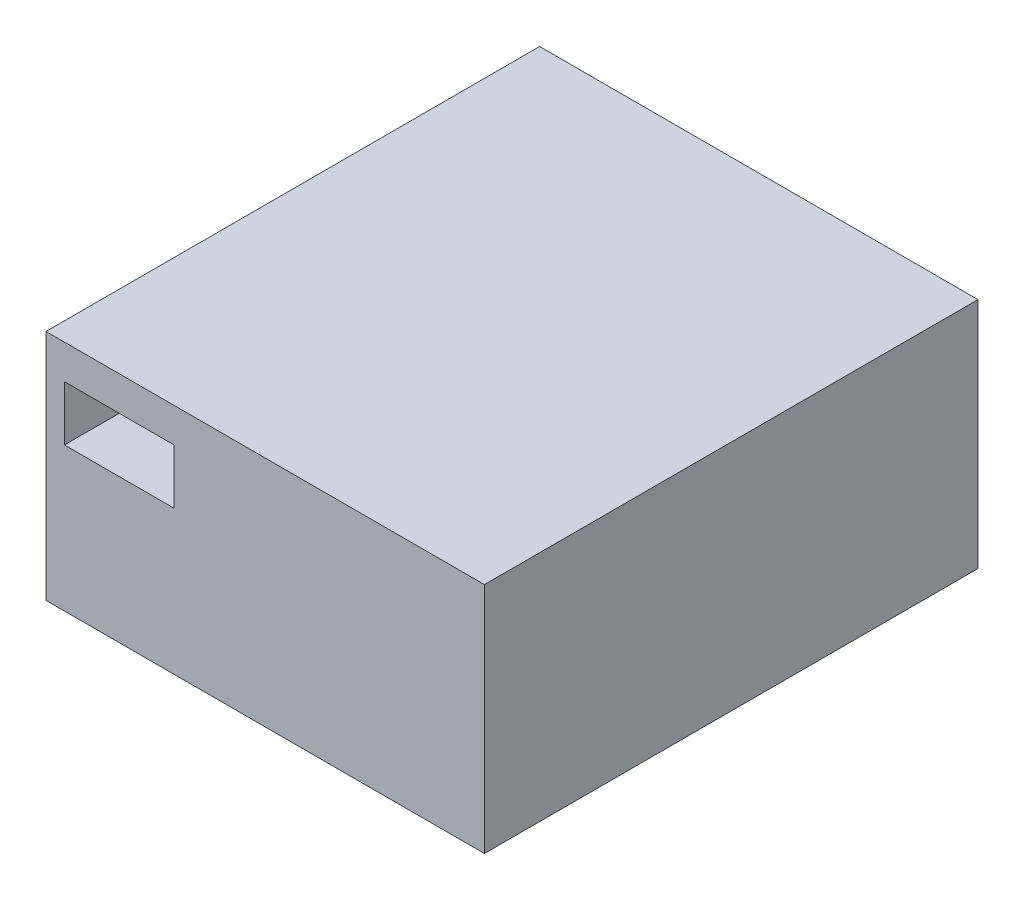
ISO-10303-21;
HEADER;
FILE_DESCRIPTION(('STEP AP214'),'2;1');
FILE_NAME('part.step','',(''),(''),'','','');
FILE_SCHEMA(('AUTOMOTIVE_DESIGN { 1 0 10303 214 1 1 1 1 }'));
ENDSEC;
DATA;
#1=APPLICATION_CONTEXT('core data for automotive mechanical design processes');
#2=APPLICATION_PROTOCOL_DEFINITION('international standard','automotive_design',2000,#1);
#3=PRODUCT_CONTEXT('',#1,'mechanical');
#4=PRODUCT('Part','Part','',(#3));
#5=PRODUCT_RELATED_PRODUCT_CATEGORY('part','',(#4));
#6=PRODUCT_DEFINITION_FORMATION('','',#4);
#7=PRODUCT_DEFINITION_CONTEXT('part definition',#1,'design');
#8=PRODUCT_DEFINITION('design','',#6,#7);
#9=PRODUCT_DEFINITION_SHAPE('','',#8);
#10=(LENGTH_UNIT() NAMED_UNIT(*) SI_UNIT(.MILLI.,.METRE.));
#11=(NAMED_UNIT(*) PLANE_ANGLE_UNIT() SI_UNIT($,.RADIAN.));
#12=(NAMED_UNIT(*) SI_UNIT($,.STERADIAN.) SOLID_ANGLE_UNIT());
#13=UNCERTAINTY_MEASURE_WITH_UNIT(LENGTH_MEASURE(1.E-05),#10,'distance_accuracy_value','');
#14=(GEOMETRIC_REPRESENTATION_CONTEXT(3) GLOBAL_UNCERTAINTY_ASSIGNED_CONTEXT((#13)) GLOBAL_UNIT_ASSIGNED_CONTEXT((#10,
#11,#12)) REPRESENTATION_CONTEXT('',''));
#15=CARTESIAN_POINT('',(0.,0.,0.));
#16=DIRECTION('',(0.,0.,1.));
#17=DIRECTION('',(1.,0.,0.));
#18=AXIS2_PLACEMENT_3D('',#15,#16,#17);
#19=CARTESIAN_POINT('',(0.,0.,9.00696780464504));
#20=DIRECTION('',(0.,0.,1.));
#21=DIRECTION('',(1.,0.,0.));
#22=AXIS2_PLACEMENT_3D('',#19,#20,#21);
#23=PLANE('',#22);
#24=DIRECTION('',(0.,1.,0.));
#25=VECTOR('',#24,1.);
#26=CARTESIAN_POINT('',(-7.32683432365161,-4.33691413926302,9.00696780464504));
#27=LINE('',#26,#25);
#28=CARTESIAN_POINT('',(-7.32683432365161,-6.33691413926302,9.00696780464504));
#29=VERTEX_POINT('',#28);
#30=CARTESIAN_POINT('',(-7.32683432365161,-4.33691413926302,9.00696780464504));
#31=VERTEX_POINT('',#30);
#32=EDGE_CURVE('E487',#29,#31,#27,.T.);
#33=ORIENTED_EDGE('',*,*,#32,.T.);
#34=DIRECTION('',(1.,0.,0.));
#35=VECTOR('',#34,1.);
#36=CARTESIAN_POINT('',(-7.32683432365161,-4.33691413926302,9.00696780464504));
#37=LINE('',#36,#35);
#38=CARTESIAN_POINT('',(-3.32683432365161,-4.33691413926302,9.00696780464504));
#39=VERTEX_POINT('',#38);
#40=EDGE_CURVE('E485',#31,#39,#37,.T.);
#41=ORIENTED_EDGE('',*,*,#40,.T.);
#42=DIRECTION('',(3.63814880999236E-12,-1.,0.));
#43=VECTOR('',#42,1.);
#44=CARTESIAN_POINT('',(-3.32683432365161,-4.33691413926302,9.00696780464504));
#45=LINE('',#44,#43);
#46=CARTESIAN_POINT('',(-3.32683432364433,-6.33691413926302,9.00696780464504));
#47=VERTEX_POINT('',#46);
#48=EDGE_CURVE('E483',#39,#47,#45,.T.);
#49=ORIENTED_EDGE('',*,*,#48,.T.);
#50=DIRECTION('',(-1.,0.,0.));
#51=VECTOR('',#50,1.);
#52=CARTESIAN_POINT('',(-7.32683432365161,-6.33691413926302,9.00696780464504));
#53=LINE('',#52,#51);
#54=EDGE_CURVE('E481',#47,#29,#53,.T.);
#55=ORIENTED_EDGE('',*,*,#54,.T.);
#56=EDGE_LOOP('',(#33,#41,#49,#55));
#57=FACE_BOUND('',#56,.T.);
#58=DIRECTION('',(-1.,0.,0.));
#59=VECTOR('',#58,1.);
#60=CARTESIAN_POINT('',(-8.82683432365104,-11.586914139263,9.00696780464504));
#61=LINE('',#60,#59);
#62=CARTESIAN_POINT('',(7.99999982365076,-11.586914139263,9.00696780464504));
#63=VERTEX_POINT('',#62);
#64=CARTESIAN_POINT('',(-7.99999982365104,-11.586914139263,9.00696780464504));
#65=VERTEX_POINT('',#64);
#66=EDGE_CURVE('E464',#63,#65,#61,.T.);
#67=ORIENTED_EDGE('',*,*,#66,.F.);
#68=DIRECTION('',(0.,-1.,0.));
#69=VECTOR('',#68,1.);
#70=CARTESIAN_POINT('',(7.99999982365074,-3.08691413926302,9.00696780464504));
#71=LINE('',#70,#69);
#72=CARTESIAN_POINT('',(7.99999982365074,-3.08691413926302,9.00696780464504));
#73=VERTEX_POINT('',#72);
#74=EDGE_CURVE('E85',#73,#63,#71,.T.);
#75=ORIENTED_EDGE('',*,*,#74,.F.);
#76=DIRECTION('',(-1.,0.,0.));
#77=VECTOR('',#76,1.);
#78=CARTESIAN_POINT('',(-8.82683432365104,-3.08691413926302,9.00696780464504));
#79=LINE('',#78,#77);
#80=CARTESIAN_POINT('',(-7.99999982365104,-3.08691413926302,9.00696780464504));
#81=VERTEX_POINT('',#80);
#82=EDGE_CURVE('E479',#73,#81,#79,.T.);
#83=ORIENTED_EDGE('',*,*,#82,.T.);
#84=DIRECTION('',(0.,1.,0.));
#85=VECTOR('',#84,1.);
#86=CARTESIAN_POINT('',(-7.99999982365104,-3.08691413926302,9.00696780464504));
#87=LINE('',#86,#85);
#88=EDGE_CURVE('E468',#65,#81,#87,.T.);
#89=ORIENTED_EDGE('',*,*,#88,.F.);
#90=EDGE_LOOP('',(#67,#75,#83,#89));
#91=FACE_BOUND('',#90,.T.);
#92=ADVANCED_FACE('F69',(#57,#91),#23,.T.);
#93=CARTESIAN_POINT('',(0.,0.,-9.00696780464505));
#94=DIRECTION('',(0.,0.,-1.));
#95=DIRECTION('',(-1.,0.,0.));
#96=AXIS2_PLACEMENT_3D('',#93,#94,#95);
#97=PLANE('',#96);
#98=DIRECTION('',(0.,1.,0.));
#99=VECTOR('',#98,1.);
#100=CARTESIAN_POINT('',(7.32683432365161,-4.33691413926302,-9.00696780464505));
#101=LINE('',#100,#99);
#102=CARTESIAN_POINT('',(7.32683432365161,-6.33691413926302,-9.00696780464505));
#103=VERTEX_POINT('',#102);
#104=CARTESIAN_POINT('',(7.32683432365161,-4.33691413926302,-9.00696780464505));
#105=VERTEX_POINT('',#104);
#106=EDGE_CURVE('E477',#103,#105,#101,.T.);
#107=ORIENTED_EDGE('',*,*,#106,.T.);
#108=DIRECTION('',(-1.,0.,0.));
#109=VECTOR('',#108,1.);
#110=CARTESIAN_POINT('',(7.32683432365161,-4.33691413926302,-9.00696780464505));
#111=LINE('',#110,#109);
#112=CARTESIAN_POINT('',(3.32683432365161,-4.33691413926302,-9.00696780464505));
#113=VERTEX_POINT('',#112);
#114=EDGE_CURVE('E475',#105,#113,#111,.T.);
#115=ORIENTED_EDGE('',*,*,#114,.T.);
#116=DIRECTION('',(-3.63814880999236E-12,-1.,0.));
#117=VECTOR('',#116,1.);
#118=CARTESIAN_POINT('',(3.32683432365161,-4.33691413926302,-9.00696780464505));
#119=LINE('',#118,#117);
#120=CARTESIAN_POINT('',(3.32683432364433,-6.33691413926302,-9.00696780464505));
#121=VERTEX_POINT('',#120);
#122=EDGE_CURVE('E473',#113,#121,#119,.T.);
#123=ORIENTED_EDGE('',*,*,#122,.T.);
#124=DIRECTION('',(1.,0.,0.));
#125=VECTOR('',#124,1.);
#126=CARTESIAN_POINT('',(7.32683432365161,-6.33691413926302,-9.00696780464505));
#127=LINE('',#126,#125);
#128=EDGE_CURVE('E12',#121,#103,#127,.T.);
#129=ORIENTED_EDGE('',*,*,#128,.T.);
#130=EDGE_LOOP('',(#107,#115,#123,#129));
#131=FACE_BOUND('',#130,.T.);
#132=DIRECTION('',(1.,0.,0.));
#133=VECTOR('',#132,1.);
#134=CARTESIAN_POINT('',(8.82683432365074,-3.08691413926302,-9.00696780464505));
#135=LINE('',#134,#133);
#136=CARTESIAN_POINT('',(-7.99999982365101,-3.08691413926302,-9.00696780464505));
#137=VERTEX_POINT('',#136);
#138=CARTESIAN_POINT('',(7.99999982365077,-3.08691413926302,-9.00696780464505));
#139=VERTEX_POINT('',#138);
#140=EDGE_CURVE('E459',#137,#139,#135,.T.);
#141=ORIENTED_EDGE('',*,*,#140,.T.);
#142=DIRECTION('',(0.,1.,0.));
#143=VECTOR('',#142,1.);
#144=CARTESIAN_POINT('',(7.99999982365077,-3.08691413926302,-9.00696780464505));
#145=LINE('',#144,#143);
#146=CARTESIAN_POINT('',(7.99999982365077,-11.586914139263,-9.00696780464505));
#147=VERTEX_POINT('',#146);
#148=EDGE_CURVE('E447',#147,#139,#145,.T.);
#149=ORIENTED_EDGE('',*,*,#148,.F.);
#150=DIRECTION('',(1.,0.,0.));
#151=VECTOR('',#150,1.);
#152=CARTESIAN_POINT('',(-8.82683432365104,-11.586914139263,-9.00696780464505));
#153=LINE('',#152,#151);
#154=CARTESIAN_POINT('',(-7.99999982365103,-11.586914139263,-9.00696780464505));
#155=VERTEX_POINT('',#154);
#156=EDGE_CURVE('E457',#155,#147,#153,.T.);
#157=ORIENTED_EDGE('',*,*,#156,.F.);
#158=DIRECTION('',(0.,-1.,0.));
#159=VECTOR('',#158,1.);
#160=CARTESIAN_POINT('',(-7.99999982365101,-3.08691413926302,-9.00696780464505));
#161=LINE('',#160,#159);
#162=EDGE_CURVE('E93',#137,#155,#161,.T.);
#163=ORIENTED_EDGE('',*,*,#162,.F.);
#164=EDGE_LOOP('',(#141,#149,#157,#163));
#165=FACE_BOUND('',#164,.T.);
#166=ADVANCED_FACE('F456',(#131,#165),#97,.T.);
#167=CARTESIAN_POINT('',(0.,-3.08691413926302,0.));
#168=DIRECTION('',(0.,-1.,0.));
#169=DIRECTION('',(0.,0.,-1.));
#170=AXIS2_PLACEMENT_3D('',#167,#168,#169);
#171=PLANE('',#170);
#172=DIRECTION('',(0.,0.,1.));
#173=VECTOR('',#172,1.);
#174=CARTESIAN_POINT('',(7.99999982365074,-3.08691413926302,9.00696780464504));
#175=LINE('',#174,#173);
#176=EDGE_CURVE('E460',#139,#73,#175,.T.);
#177=ORIENTED_EDGE('',*,*,#176,.F.);
#178=ORIENTED_EDGE('',*,*,#140,.F.);
#179=DIRECTION('',(0.,0.,-1.));
#180=VECTOR('',#179,1.);
#181=CARTESIAN_POINT('',(-7.99999982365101,-3.08691413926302,-9.00696780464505));
#182=LINE('',#181,#180);
#183=EDGE_CURVE('E465',#81,#137,#182,.T.);
#184=ORIENTED_EDGE('',*,*,#183,.F.);
#185=ORIENTED_EDGE('',*,*,#82,.F.);
#186=EDGE_LOOP('',(#177,#178,#184,#185));
#187=FACE_BOUND('',#186,.T.);
#188=ADVANCED_FACE('F1111',(#187),#171,.F.);
#189=CARTESIAN_POINT('',(0.,-11.586914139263,0.));
#190=DIRECTION('',(0.,-1.,0.));
#191=DIRECTION('',(0.,0.,-1.));
#192=AXIS2_PLACEMENT_3D('',#189,#190,#191);
#193=PLANE('',#192);
#194=CARTESIAN_POINT('',(0.,-11.586914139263,0.));
#195=DIRECTION('',(0.,-1.,0.));
#196=DIRECTION('',(0.,0.,-1.));
#197=AXIS2_PLACEMENT_3D('',#194,#195,#196);
#198=CIRCLE('',#197,6.42524319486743);
#199=CARTESIAN_POINT('',(0.,-11.586914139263,-6.42524319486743));
#200=VERTEX_POINT('',#199);
#201=EDGE_CURVE('E2039',#200,#200,#198,.T.);
#202=ORIENTED_EDGE('',*,*,#201,.F.);
#203=EDGE_LOOP('',(#202));
#204=FACE_BOUND('',#203,.T.);
#205=ORIENTED_EDGE('',*,*,#156,.T.);
#206=DIRECTION('',(0.,0.,-1.));
#207=VECTOR('',#206,1.);
#208=CARTESIAN_POINT('',(7.99999982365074,-11.586914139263,9.00696780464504));
#209=LINE('',#208,#207);
#210=EDGE_CURVE('E444',#63,#147,#209,.T.);
#211=ORIENTED_EDGE('',*,*,#210,.F.);
#212=ORIENTED_EDGE('',*,*,#66,.T.);
#213=DIRECTION('',(0.,0.,1.));
#214=VECTOR('',#213,1.);
#215=CARTESIAN_POINT('',(-7.99999982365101,-11.586914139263,-9.00696780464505));
#216=LINE('',#215,#214);
#217=EDGE_CURVE('E463',#155,#65,#216,.T.);
#218=ORIENTED_EDGE('',*,*,#217,.F.);
#219=EDGE_LOOP('',(#205,#211,#212,#218));
#220=FACE_BOUND('',#219,.T.);
#221=ADVANCED_FACE('F462',(#204,#220),#193,.T.);
#222=CARTESIAN_POINT('',(-5.32683432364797,-8.33691413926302,1.));
#223=DIRECTION('',(0.,1.,0.));
#224=DIRECTION('',(0.,0.,1.));
#225=AXIS2_PLACEMENT_3D('',#222,#223,#224);
#226=PLANE('',#225);
#227=CARTESIAN_POINT('',(-5.32683432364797,-8.33691413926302,1.));
#228=DIRECTION('',(0.,1.,0.));
#229=DIRECTION('',(0.,0.,1.));
#230=AXIS2_PLACEMENT_3D('',#227,#228,#229);
#231=CIRCLE('',#230,1.5);
#232=CARTESIAN_POINT('',(-5.32683432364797,-8.33691413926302,2.5));
#233=VERTEX_POINT('',#232);
#234=EDGE_CURVE('E489',#233,#233,#231,.T.);
#235=ORIENTED_EDGE('',*,*,#234,.T.);
#236=EDGE_LOOP('',(#235));
#237=FACE_BOUND('',#236,.T.);
#238=ADVANCED_FACE('F1138',(#237),#226,.T.);
#239=CARTESIAN_POINT('',(-5.32683432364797,-9.53691413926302,-2.5));
#240=DIRECTION('',(0.,1.,0.));
#241=DIRECTION('',(0.,0.,1.));
#242=AXIS2_PLACEMENT_3D('',#239,#240,#241);
#243=PLANE('',#242);
#244=CARTESIAN_POINT('',(-5.32683432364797,-9.53691413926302,-2.5));
#245=DIRECTION('',(0.,1.,0.));
#246=DIRECTION('',(0.,0.,1.));
#247=AXIS2_PLACEMENT_3D('',#244,#245,#246);
#248=CIRCLE('',#247,1.5);
#249=CARTESIAN_POINT('',(-5.32683432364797,-9.53691413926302,-1.));
#250=VERTEX_POINT('',#249);
#251=EDGE_CURVE('E493',#250,#250,#248,.T.);
#252=ORIENTED_EDGE('',*,*,#251,.T.);
#253=EDGE_LOOP('',(#252));
#254=FACE_BOUND('',#253,.T.);
#255=ADVANCED_FACE('F1141',(#254),#243,.T.);
#256=CARTESIAN_POINT('',(-5.32683432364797,-11.136914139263,-6.));
#257=DIRECTION('',(0.,1.,0.));
#258=DIRECTION('',(0.,0.,1.));
#259=AXIS2_PLACEMENT_3D('',#256,#257,#258);
#260=PLANE('',#259);
#261=CARTESIAN_POINT('',(-5.32683432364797,-11.136914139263,-6.));
#262=DIRECTION('',(0.,1.,0.));
#263=DIRECTION('',(0.,0.,1.));
#264=AXIS2_PLACEMENT_3D('',#261,#262,#263);
#265=CIRCLE('',#264,1.5);
#266=CARTESIAN_POINT('',(-5.32683432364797,-11.136914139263,-4.5));
#267=VERTEX_POINT('',#266);
#268=EDGE_CURVE('E505',#267,#267,#265,.T.);
#269=ORIENTED_EDGE('',*,*,#268,.T.);
#270=EDGE_LOOP('',(#269));
#271=FACE_BOUND('',#270,.T.);
#272=ADVANCED_FACE('F1157',(#271),#260,.T.);
#273=CARTESIAN_POINT('',(0.,0.,-8.49303219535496));
#274=DIRECTION('',(0.,0.,1.));
#275=DIRECTION('',(1.,0.,0.));
#276=AXIS2_PLACEMENT_3D('',#273,#274,#275);
#277=PLANE('',#276);
#278=DIRECTION('',(0.,-1.,0.));
#279=VECTOR('',#278,1.);
#280=CARTESIAN_POINT('',(-7.32683432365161,-4.33691413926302,-8.49303219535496));
#281=LINE('',#280,#279);
#282=CARTESIAN_POINT('',(-7.32683432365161,-4.33691413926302,-8.49303219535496));
#283=VERTEX_POINT('',#282);
#284=CARTESIAN_POINT('',(-7.32683432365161,-6.33691413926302,-8.49303219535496));
#285=VERTEX_POINT('',#284);
#286=EDGE_CURVE('E517',#283,#285,#281,.T.);
#287=ORIENTED_EDGE('',*,*,#286,.T.);
#288=DIRECTION('',(1.,0.,0.));
#289=VECTOR('',#288,1.);
#290=CARTESIAN_POINT('',(-7.32683432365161,-6.33691413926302,-8.49303219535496));
#291=LINE('',#290,#289);
#292=CARTESIAN_POINT('',(-3.32683432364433,-6.33691413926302,-8.49303219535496));
#293=VERTEX_POINT('',#292);
#294=EDGE_CURVE('E528',#285,#293,#291,.T.);
#295=ORIENTED_EDGE('',*,*,#294,.T.);
#296=DIRECTION('',(-3.63814880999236E-12,1.,0.));
#297=VECTOR('',#296,1.);
#298=CARTESIAN_POINT('',(-3.32683432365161,-4.33691413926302,-8.49303219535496));
#299=LINE('',#298,#297);
#300=CARTESIAN_POINT('',(-3.32683432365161,-4.33691413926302,-8.49303219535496));
#301=VERTEX_POINT('',#300);
#302=EDGE_CURVE('E531',#293,#301,#299,.T.);
#303=ORIENTED_EDGE('',*,*,#302,.T.);
#304=DIRECTION('',(-1.,0.,0.));
#305=VECTOR('',#304,1.);
#306=CARTESIAN_POINT('',(-7.32683432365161,-4.33691413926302,-8.49303219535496));
#307=LINE('',#306,#305);
#308=EDGE_CURVE('E534',#301,#283,#307,.T.);
#309=ORIENTED_EDGE('',*,*,#308,.T.);
#310=EDGE_LOOP('',(#287,#295,#303,#309));
#311=FACE_BOUND('',#310,.T.);
#312=ADVANCED_FACE('F1136',(#311),#277,.T.);
#313=CARTESIAN_POINT('',(-5.32683432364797,-8.33691413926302,1.));
#314=DIRECTION('',(0.,1.,0.));
#315=DIRECTION('',(0.,0.,1.));
#316=AXIS2_PLACEMENT_3D('',#313,#314,#315);
#317=CYLINDRICAL_SURFACE('',#316,1.5);
#318=ORIENTED_EDGE('',*,*,#234,.F.);
#319=EDGE_LOOP('',(#318));
#320=FACE_BOUND('',#319,.T.);
#321=CARTESIAN_POINT('',(-5.32683432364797,-6.33691413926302,1.));
#322=DIRECTION('',(0.,1.,0.));
#323=DIRECTION('',(0.,0.,1.));
#324=AXIS2_PLACEMENT_3D('',#321,#322,#323);
#325=CIRCLE('',#324,1.5);
#326=CARTESIAN_POINT('',(-5.32683432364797,-6.33691413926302,2.5));
#327=VERTEX_POINT('',#326);
#328=EDGE_CURVE('E497',#327,#327,#325,.T.);
#329=ORIENTED_EDGE('',*,*,#328,.T.);
#330=EDGE_LOOP('',(#329));
#331=FACE_BOUND('',#330,.T.);
#332=ADVANCED_FACE('F1132',(#320,#331),#317,.F.);
#333=CARTESIAN_POINT('',(-5.32683432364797,-9.53691413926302,-2.5));
#334=DIRECTION('',(0.,1.,0.));
#335=DIRECTION('',(0.,0.,1.));
#336=AXIS2_PLACEMENT_3D('',#333,#334,#335);
#337=CYLINDRICAL_SURFACE('',#336,1.5);
#338=ORIENTED_EDGE('',*,*,#251,.F.);
#339=EDGE_LOOP('',(#338));
#340=FACE_BOUND('',#339,.T.);
#341=CARTESIAN_POINT('',(-5.32683432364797,-6.33691413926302,-2.5));
#342=DIRECTION('',(0.,1.,0.));
#343=DIRECTION('',(0.,0.,1.));
#344=AXIS2_PLACEMENT_3D('',#341,#342,#343);
#345=CIRCLE('',#344,1.5);
#346=CARTESIAN_POINT('',(-5.32683432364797,-6.33691413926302,-1.));
#347=VERTEX_POINT('',#346);
#348=EDGE_CURVE('E509',#347,#347,#345,.T.);
#349=ORIENTED_EDGE('',*,*,#348,.T.);
#350=EDGE_LOOP('',(#349));
#351=FACE_BOUND('',#350,.T.);
#352=ADVANCED_FACE('F1135',(#340,#351),#337,.F.);
#353=CARTESIAN_POINT('',(-5.32683432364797,-11.136914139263,-6.));
#354=DIRECTION('',(0.,1.,0.));
#355=DIRECTION('',(0.,0.,1.));
#356=AXIS2_PLACEMENT_3D('',#353,#354,#355);
#357=CYLINDRICAL_SURFACE('',#356,1.5);
#358=ORIENTED_EDGE('',*,*,#268,.F.);
#359=EDGE_LOOP('',(#358));
#360=FACE_BOUND('',#359,.T.);
#361=CARTESIAN_POINT('',(-5.32683432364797,-6.33691413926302,-6.));
#362=DIRECTION('',(0.,1.,0.));
#363=DIRECTION('',(0.,0.,1.));
#364=AXIS2_PLACEMENT_3D('',#361,#362,#363);
#365=CIRCLE('',#364,1.5);
#366=CARTESIAN_POINT('',(-5.32683432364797,-6.33691413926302,-4.5));
#367=VERTEX_POINT('',#366);
#368=EDGE_CURVE('E521',#367,#367,#365,.T.);
#369=ORIENTED_EDGE('',*,*,#368,.T.);
#370=EDGE_LOOP('',(#369));
#371=FACE_BOUND('',#370,.T.);
#372=ADVANCED_FACE('F1153',(#360,#371),#357,.F.);
#373=CARTESIAN_POINT('',(-7.32683432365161,-6.33691413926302,-8.49303219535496));
#374=DIRECTION('',(0.,-1.,0.));
#375=DIRECTION('',(0.,0.,-1.));
#376=AXIS2_PLACEMENT_3D('',#373,#374,#375);
#377=PLANE('',#376);
#378=ORIENTED_EDGE('',*,*,#368,.F.);
#379=EDGE_LOOP('',(#378));
#380=FACE_BOUND('',#379,.T.);
#381=ORIENTED_EDGE('',*,*,#348,.F.);
#382=EDGE_LOOP('',(#381));
#383=FACE_BOUND('',#382,.T.);
#384=ORIENTED_EDGE('',*,*,#328,.F.);
#385=EDGE_LOOP('',(#384));
#386=FACE_BOUND('',#385,.T.);
#387=ORIENTED_EDGE('',*,*,#54,.F.);
#388=DIRECTION('',(0.,0.,1.));
#389=VECTOR('',#388,1.);
#390=CARTESIAN_POINT('',(-3.32683432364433,-6.33691413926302,-8.49303219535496));
#391=LINE('',#390,#389);
#392=EDGE_CURVE('E545',#293,#47,#391,.T.);
#393=ORIENTED_EDGE('',*,*,#392,.F.);
#394=ORIENTED_EDGE('',*,*,#294,.F.);
#395=DIRECTION('',(0.,0.,1.));
#396=VECTOR('',#395,1.);
#397=CARTESIAN_POINT('',(-7.32683432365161,-6.33691413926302,-8.49303219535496));
#398=LINE('',#397,#396);
#399=EDGE_CURVE('E537',#285,#29,#398,.T.);
#400=ORIENTED_EDGE('',*,*,#399,.T.);
#401=EDGE_LOOP('',(#387,#393,#394,#400));
#402=FACE_BOUND('',#401,.T.);
#403=ADVANCED_FACE('F1168',(#380,#383,#386,#402),#377,.F.);
#404=CARTESIAN_POINT('',(-3.32683432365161,-4.33691413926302,-8.49303219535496));
#405=DIRECTION('',(1.,3.63814880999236E-12,0.));
#406=DIRECTION('',(-3.63814880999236E-12,1.,0.));
#407=AXIS2_PLACEMENT_3D('',#404,#405,#406);
#408=PLANE('',#407);
#409=ORIENTED_EDGE('',*,*,#48,.F.);
#410=DIRECTION('',(0.,0.,1.));
#411=VECTOR('',#410,1.);
#412=CARTESIAN_POINT('',(-3.32683432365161,-4.33691413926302,-8.49303219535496));
#413=LINE('',#412,#411);
#414=EDGE_CURVE('E542',#301,#39,#413,.T.);
#415=ORIENTED_EDGE('',*,*,#414,.F.);
#416=ORIENTED_EDGE('',*,*,#302,.F.);
#417=ORIENTED_EDGE('',*,*,#392,.T.);
#418=EDGE_LOOP('',(#409,#415,#416,#417));
#419=FACE_BOUND('',#418,.T.);
#420=ADVANCED_FACE('F1179',(#419),#408,.F.);
#421=CARTESIAN_POINT('',(-7.32683432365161,-4.33691413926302,-8.49303219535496));
#422=DIRECTION('',(0.,1.,0.));
#423=DIRECTION('',(0.,0.,1.));
#424=AXIS2_PLACEMENT_3D('',#421,#422,#423);
#425=PLANE('',#424);
#426=ORIENTED_EDGE('',*,*,#40,.F.);
#427=DIRECTION('',(0.,0.,1.));
#428=VECTOR('',#427,1.);
#429=CARTESIAN_POINT('',(-7.32683432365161,-4.33691413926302,-8.49303219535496));
#430=LINE('',#429,#428);
#431=EDGE_CURVE('E538',#283,#31,#430,.T.);
#432=ORIENTED_EDGE('',*,*,#431,.F.);
#433=ORIENTED_EDGE('',*,*,#308,.F.);
#434=ORIENTED_EDGE('',*,*,#414,.T.);
#435=EDGE_LOOP('',(#426,#432,#433,#434));
#436=FACE_BOUND('',#435,.T.);
#437=ADVANCED_FACE('F1176',(#436),#425,.F.);
#438=CARTESIAN_POINT('',(-7.32683432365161,-4.33691413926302,-8.49303219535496));
#439=DIRECTION('',(-1.,0.,0.));
#440=DIRECTION('',(0.,-1.,0.));
#441=AXIS2_PLACEMENT_3D('',#438,#439,#440);
#442=PLANE('',#441);
#443=ORIENTED_EDGE('',*,*,#32,.F.);
#444=ORIENTED_EDGE('',*,*,#399,.F.);
#445=ORIENTED_EDGE('',*,*,#286,.F.);
#446=ORIENTED_EDGE('',*,*,#431,.T.);
#447=EDGE_LOOP('',(#443,#444,#445,#446));
#448=FACE_BOUND('',#447,.T.);
#449=ADVANCED_FACE('F1124',(#448),#442,.F.);
#450=CARTESIAN_POINT('',(5.32683432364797,-8.33691413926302,-1.));
#451=DIRECTION('',(0.,1.,0.));
#452=DIRECTION('',(0.,0.,1.));
#453=AXIS2_PLACEMENT_3D('',#450,#451,#452);
#454=PLANE('',#453);
#455=CARTESIAN_POINT('',(5.32683432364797,-8.33691413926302,-1.));
#456=DIRECTION('',(0.,1.,0.));
#457=DIRECTION('',(0.,0.,1.));
#458=AXIS2_PLACEMENT_3D('',#455,#456,#457);
#459=CIRCLE('',#458,1.5);
#460=CARTESIAN_POINT('',(5.32683432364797,-8.33691413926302,0.499999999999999));
#461=VERTEX_POINT('',#460);
#462=EDGE_CURVE('E490',#461,#461,#459,.T.);
#463=ORIENTED_EDGE('',*,*,#462,.T.);
#464=EDGE_LOOP('',(#463));
#465=FACE_BOUND('',#464,.T.);
#466=ADVANCED_FACE('F1120',(#465),#454,.T.);
#467=CARTESIAN_POINT('',(5.32683432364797,-9.53691413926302,2.5));
#468=DIRECTION('',(0.,1.,0.));
#469=DIRECTION('',(0.,0.,1.));
#470=AXIS2_PLACEMENT_3D('',#467,#468,#469);
#471=PLANE('',#470);
#472=CARTESIAN_POINT('',(5.32683432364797,-9.53691413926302,2.5));
#473=DIRECTION('',(0.,1.,0.));
#474=DIRECTION('',(0.,0.,1.));
#475=AXIS2_PLACEMENT_3D('',#472,#473,#474);
#476=CIRCLE('',#475,1.5);
#477=CARTESIAN_POINT('',(5.32683432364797,-9.53691413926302,4.));
#478=VERTEX_POINT('',#477);
#479=EDGE_CURVE('E502',#478,#478,#476,.T.);
#480=ORIENTED_EDGE('',*,*,#479,.T.);
#481=EDGE_LOOP('',(#480));
#482=FACE_BOUND('',#481,.T.);
#483=ADVANCED_FACE('F1123',(#482),#471,.T.);
#484=CARTESIAN_POINT('',(5.32683432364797,-11.136914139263,6.));
#485=DIRECTION('',(0.,1.,0.));
#486=DIRECTION('',(0.,0.,1.));
#487=AXIS2_PLACEMENT_3D('',#484,#485,#486);
#488=PLANE('',#487);
#489=CARTESIAN_POINT('',(5.32683432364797,-11.136914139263,6.));
#490=DIRECTION('',(0.,1.,0.));
#491=DIRECTION('',(0.,0.,1.));
#492=AXIS2_PLACEMENT_3D('',#489,#490,#491);
#493=CIRCLE('',#492,1.5);
#494=CARTESIAN_POINT('',(5.32683432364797,-11.136914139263,7.5));
#495=VERTEX_POINT('',#494);
#496=EDGE_CURVE('E514',#495,#495,#493,.T.);
#497=ORIENTED_EDGE('',*,*,#496,.T.);
#498=EDGE_LOOP('',(#497));
#499=FACE_BOUND('',#498,.T.);
#500=ADVANCED_FACE('F1145',(#499),#488,.T.);
#501=CARTESIAN_POINT('',(0.,0.,8.49303219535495));
#502=DIRECTION('',(0.,0.,-1.));
#503=DIRECTION('',(-1.,0.,0.));
#504=AXIS2_PLACEMENT_3D('',#501,#502,#503);
#505=PLANE('',#504);
#506=DIRECTION('',(0.,-1.,0.));
#507=VECTOR('',#506,1.);
#508=CARTESIAN_POINT('',(7.32683432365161,-4.33691413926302,8.49303219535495));
#509=LINE('',#508,#507);
#510=CARTESIAN_POINT('',(7.32683432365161,-4.33691413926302,8.49303219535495));
#511=VERTEX_POINT('',#510);
#512=CARTESIAN_POINT('',(7.32683432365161,-6.33691413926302,8.49303219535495));
#513=VERTEX_POINT('',#512);
#514=EDGE_CURVE('E541',#511,#513,#509,.T.);
#515=ORIENTED_EDGE('',*,*,#514,.T.);
#516=DIRECTION('',(-1.,0.,0.));
#517=VECTOR('',#516,1.);
#518=CARTESIAN_POINT('',(7.32683432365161,-6.33691413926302,8.49303219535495));
#519=LINE('',#518,#517);
#520=CARTESIAN_POINT('',(3.32683432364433,-6.33691413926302,8.49303219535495));
#521=VERTEX_POINT('',#520);
#522=EDGE_CURVE('E552',#513,#521,#519,.T.);
#523=ORIENTED_EDGE('',*,*,#522,.T.);
#524=DIRECTION('',(3.63814880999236E-12,1.,0.));
#525=VECTOR('',#524,1.);
#526=CARTESIAN_POINT('',(3.32683432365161,-4.33691413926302,8.49303219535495));
#527=LINE('',#526,#525);
#528=CARTESIAN_POINT('',(3.32683432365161,-4.33691413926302,8.49303219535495));
#529=VERTEX_POINT('',#528);
#530=EDGE_CURVE('E555',#521,#529,#527,.T.);
#531=ORIENTED_EDGE('',*,*,#530,.T.);
#532=DIRECTION('',(1.,0.,0.));
#533=VECTOR('',#532,1.);
#534=CARTESIAN_POINT('',(7.32683432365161,-4.33691413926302,8.49303219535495));
#535=LINE('',#534,#533);
#536=EDGE_CURVE('E558',#529,#511,#535,.T.);
#537=ORIENTED_EDGE('',*,*,#536,.T.);
#538=EDGE_LOOP('',(#515,#523,#531,#537));
#539=FACE_BOUND('',#538,.T.);
#540=ADVANCED_FACE('F1130',(#539),#505,.T.);
#541=CARTESIAN_POINT('',(5.32683432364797,-8.33691413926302,-1.));
#542=DIRECTION('',(0.,1.,0.));
#543=DIRECTION('',(0.,0.,1.));
#544=AXIS2_PLACEMENT_3D('',#541,#542,#543);
#545=CYLINDRICAL_SURFACE('',#544,1.5);
#546=ORIENTED_EDGE('',*,*,#462,.F.);
#547=EDGE_LOOP('',(#546));
#548=FACE_BOUND('',#547,.T.);
#549=CARTESIAN_POINT('',(5.32683432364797,-6.33691413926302,-1.));
#550=DIRECTION('',(0.,1.,0.));
#551=DIRECTION('',(0.,0.,1.));
#552=AXIS2_PLACEMENT_3D('',#549,#550,#551);
#553=CIRCLE('',#552,1.5);
#554=CARTESIAN_POINT('',(5.32683432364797,-6.33691413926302,0.499999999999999));
#555=VERTEX_POINT('',#554);
#556=EDGE_CURVE('E494',#555,#555,#553,.T.);
#557=ORIENTED_EDGE('',*,*,#556,.T.);
#558=EDGE_LOOP('',(#557));
#559=FACE_BOUND('',#558,.T.);
#560=ADVANCED_FACE('F1126',(#548,#559),#545,.F.);
#561=CARTESIAN_POINT('',(5.32683432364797,-9.53691413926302,2.5));
#562=DIRECTION('',(0.,1.,0.));
#563=DIRECTION('',(0.,0.,1.));
#564=AXIS2_PLACEMENT_3D('',#561,#562,#563);
#565=CYLINDRICAL_SURFACE('',#564,1.5);
#566=ORIENTED_EDGE('',*,*,#479,.F.);
#567=EDGE_LOOP('',(#566));
#568=FACE_BOUND('',#567,.T.);
#569=CARTESIAN_POINT('',(5.32683432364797,-6.33691413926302,2.5));
#570=DIRECTION('',(0.,1.,0.));
#571=DIRECTION('',(0.,0.,1.));
#572=AXIS2_PLACEMENT_3D('',#569,#570,#571);
#573=CIRCLE('',#572,1.5);
#574=CARTESIAN_POINT('',(5.32683432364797,-6.33691413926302,4.));
#575=VERTEX_POINT('',#574);
#576=EDGE_CURVE('E506',#575,#575,#573,.T.);
#577=ORIENTED_EDGE('',*,*,#576,.T.);
#578=EDGE_LOOP('',(#577));
#579=FACE_BOUND('',#578,.T.);
#580=ADVANCED_FACE('F1129',(#568,#579),#565,.F.);
#581=CARTESIAN_POINT('',(5.32683432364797,-11.136914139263,6.));
#582=DIRECTION('',(0.,1.,0.));
#583=DIRECTION('',(0.,0.,1.));
#584=AXIS2_PLACEMENT_3D('',#581,#582,#583);
#585=CYLINDRICAL_SURFACE('',#584,1.5);
#586=ORIENTED_EDGE('',*,*,#496,.F.);
#587=EDGE_LOOP('',(#586));
#588=FACE_BOUND('',#587,.T.);
#589=CARTESIAN_POINT('',(5.32683432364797,-6.33691413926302,6.));
#590=DIRECTION('',(0.,1.,0.));
#591=DIRECTION('',(0.,0.,1.));
#592=AXIS2_PLACEMENT_3D('',#589,#590,#591);
#593=CIRCLE('',#592,1.5);
#594=CARTESIAN_POINT('',(5.32683432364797,-6.33691413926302,7.5));
#595=VERTEX_POINT('',#594);
#596=EDGE_CURVE('E518',#595,#595,#593,.T.);
#597=ORIENTED_EDGE('',*,*,#596,.T.);
#598=EDGE_LOOP('',(#597));
#599=FACE_BOUND('',#598,.T.);
#600=ADVANCED_FACE('F1149',(#588,#599),#585,.F.);
#601=CARTESIAN_POINT('',(7.32683432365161,-6.33691413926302,8.49303219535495));
#602=DIRECTION('',(0.,-1.,0.));
#603=DIRECTION('',(0.,0.,-1.));
#604=AXIS2_PLACEMENT_3D('',#601,#602,#603);
#605=PLANE('',#604);
#606=ORIENTED_EDGE('',*,*,#596,.F.);
#607=EDGE_LOOP('',(#606));
#608=FACE_BOUND('',#607,.T.);
#609=ORIENTED_EDGE('',*,*,#576,.F.);
#610=EDGE_LOOP('',(#609));
#611=FACE_BOUND('',#610,.T.);
#612=ORIENTED_EDGE('',*,*,#556,.F.);
#613=EDGE_LOOP('',(#612));
#614=FACE_BOUND('',#613,.T.);
#615=ORIENTED_EDGE('',*,*,#128,.F.);
#616=DIRECTION('',(0.,0.,-1.));
#617=VECTOR('',#616,1.);
#618=CARTESIAN_POINT('',(3.32683432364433,-6.33691413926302,8.49303219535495));
#619=LINE('',#618,#617);
#620=EDGE_CURVE('E569',#521,#121,#619,.T.);
#621=ORIENTED_EDGE('',*,*,#620,.F.);
#622=ORIENTED_EDGE('',*,*,#522,.F.);
#623=DIRECTION('',(0.,0.,-1.));
#624=VECTOR('',#623,1.);
#625=CARTESIAN_POINT('',(7.32683432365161,-6.33691413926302,8.49303219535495));
#626=LINE('',#625,#624);
#627=EDGE_CURVE('E561',#513,#103,#626,.T.);
#628=ORIENTED_EDGE('',*,*,#627,.T.);
#629=EDGE_LOOP('',(#615,#621,#622,#628));
#630=FACE_BOUND('',#629,.T.);
#631=ADVANCED_FACE('F1164',(#608,#611,#614,#630),#605,.F.);
#632=CARTESIAN_POINT('',(3.32683432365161,-4.33691413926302,8.49303219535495));
#633=DIRECTION('',(-1.,3.63814880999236E-12,0.));
#634=DIRECTION('',(-3.63814880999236E-12,-1.,0.));
#635=AXIS2_PLACEMENT_3D('',#632,#633,#634);
#636=PLANE('',#635);
#637=ORIENTED_EDGE('',*,*,#122,.F.);
#638=DIRECTION('',(0.,0.,-1.));
#639=VECTOR('',#638,1.);
#640=CARTESIAN_POINT('',(3.32683432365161,-4.33691413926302,8.49303219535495));
#641=LINE('',#640,#639);
#642=EDGE_CURVE('E566',#529,#113,#641,.T.);
#643=ORIENTED_EDGE('',*,*,#642,.F.);
#644=ORIENTED_EDGE('',*,*,#530,.F.);
#645=ORIENTED_EDGE('',*,*,#620,.T.);
#646=EDGE_LOOP('',(#637,#643,#644,#645));
#647=FACE_BOUND('',#646,.T.);
#648=ADVANCED_FACE('F1197',(#647),#636,.F.);
#649=CARTESIAN_POINT('',(7.32683432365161,-4.33691413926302,8.49303219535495));
#650=DIRECTION('',(0.,1.,0.));
#651=DIRECTION('',(0.,0.,1.));
#652=AXIS2_PLACEMENT_3D('',#649,#650,#651);
#653=PLANE('',#652);
#654=ORIENTED_EDGE('',*,*,#114,.F.);
#655=DIRECTION('',(0.,0.,-1.));
#656=VECTOR('',#655,1.);
#657=CARTESIAN_POINT('',(7.32683432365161,-4.33691413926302,8.49303219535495));
#658=LINE('',#657,#656);
#659=EDGE_CURVE('E562',#511,#105,#658,.T.);
#660=ORIENTED_EDGE('',*,*,#659,.F.);
#661=ORIENTED_EDGE('',*,*,#536,.F.);
#662=ORIENTED_EDGE('',*,*,#642,.T.);
#663=EDGE_LOOP('',(#654,#660,#661,#662));
#664=FACE_BOUND('',#663,.T.);
#665=ADVANCED_FACE('F1193',(#664),#653,.F.);
#666=CARTESIAN_POINT('',(7.32683432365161,-4.33691413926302,8.49303219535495));
#667=DIRECTION('',(1.,0.,0.));
#668=DIRECTION('',(0.,1.,0.));
#669=AXIS2_PLACEMENT_3D('',#666,#667,#668);
#670=PLANE('',#669);
#671=ORIENTED_EDGE('',*,*,#106,.F.);
#672=ORIENTED_EDGE('',*,*,#627,.F.);
#673=ORIENTED_EDGE('',*,*,#514,.F.);
#674=ORIENTED_EDGE('',*,*,#659,.T.);
#675=EDGE_LOOP('',(#671,#672,#673,#674));
#676=FACE_BOUND('',#675,.T.);
#677=ADVANCED_FACE('F1196',(#676),#670,.F.);
#678=CARTESIAN_POINT('',(-7.99999982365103,0.,0.));
#679=DIRECTION('',(-1.,0.,0.));
#680=DIRECTION('',(0.,0.,1.));
#681=AXIS2_PLACEMENT_3D('',#678,#679,#680);
#682=PLANE('',#681);
#683=ORIENTED_EDGE('',*,*,#162,.T.);
#684=ORIENTED_EDGE('',*,*,#217,.T.);
#685=ORIENTED_EDGE('',*,*,#88,.T.);
#686=ORIENTED_EDGE('',*,*,#183,.T.);
#687=EDGE_LOOP('',(#683,#684,#685,#686));
#688=FACE_BOUND('',#687,.T.);
#689=ADVANCED_FACE('F1207',(#688),#682,.T.);
#690=CARTESIAN_POINT('',(7.99999982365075,0.,0.));
#691=DIRECTION('',(1.,0.,0.));
#692=DIRECTION('',(0.,0.,-1.));
#693=AXIS2_PLACEMENT_3D('',#690,#691,#692);
#694=PLANE('',#693);
#695=ORIENTED_EDGE('',*,*,#74,.T.);
#696=ORIENTED_EDGE('',*,*,#210,.T.);
#697=ORIENTED_EDGE('',*,*,#148,.T.);
#698=ORIENTED_EDGE('',*,*,#176,.T.);
#699=EDGE_LOOP('',(#695,#696,#697,#698));
#700=FACE_BOUND('',#699,.T.);
#701=ADVANCED_FACE('F446',(#700),#694,.T.);
#702=CARTESIAN_POINT('',(0.,-10.586914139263,0.));
#703=DIRECTION('',(0.,-1.,0.));
#704=DIRECTION('',(0.,0.,-1.));
#705=AXIS2_PLACEMENT_3D('',#702,#703,#704);
#706=PLANE('',#705);
#707=CARTESIAN_POINT('',(0.,-10.586914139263,0.));
#708=DIRECTION('',(0.,-1.,0.));
#709=DIRECTION('',(0.,0.,-1.));
#710=AXIS2_PLACEMENT_3D('',#707,#708,#709);
#711=CIRCLE('',#710,6.42524319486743);
#712=CARTESIAN_POINT('',(0.,-10.586914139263,-6.42524319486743));
#713=VERTEX_POINT('',#712);
#714=EDGE_CURVE('E2036',#713,#713,#711,.T.);
#715=ORIENTED_EDGE('',*,*,#714,.T.);
#716=EDGE_LOOP('',(#715));
#717=FACE_BOUND('',#716,.T.);
#718=CARTESIAN_POINT('',(-1.02604856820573E-13,-10.586914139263,0.));
#719=DIRECTION('',(0.,-1.,0.));
#720=DIRECTION('',(0.,0.,-1.));
#721=AXIS2_PLACEMENT_3D('',#718,#719,#720);
#722=CIRCLE('',#721,1.35437005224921);
#723=CARTESIAN_POINT('',(-1.02604856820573E-13,-10.586914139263,-1.35437005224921));
#724=VERTEX_POINT('',#723);
#725=EDGE_CURVE('E73',#724,#724,#722,.F.);
#726=ORIENTED_EDGE('',*,*,#725,.T.);
#727=EDGE_LOOP('',(#726));
#728=FACE_BOUND('',#727,.T.);
#729=ADVANCED_FACE('F1335',(#717,#728),#706,.T.);
#730=CARTESIAN_POINT('',(0.,-10.586914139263,0.));
#731=DIRECTION('',(0.,-1.,0.));
#732=DIRECTION('',(0.,0.,-1.));
#733=AXIS2_PLACEMENT_3D('',#730,#731,#732);
#734=CYLINDRICAL_SURFACE('',#733,6.42524319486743);
#735=ORIENTED_EDGE('',*,*,#714,.F.);
#736=EDGE_LOOP('',(#735));
#737=FACE_BOUND('',#736,.T.);
#738=ORIENTED_EDGE('',*,*,#201,.T.);
#739=EDGE_LOOP('',(#738));
#740=FACE_BOUND('',#739,.T.);
#741=ADVANCED_FACE('F1339',(#737,#740),#734,.F.);
#742=CARTESIAN_POINT('',(-1.79868643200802,-6.33691413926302,6.55779895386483));
#743=DIRECTION('',(0.923879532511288,0.,0.382683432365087));
#744=DIRECTION('',(0.382683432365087,0.,-0.923879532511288));
#745=AXIS2_PLACEMENT_3D('',#742,#743,#744);
#746=PLANE('',#745);
#747=DIRECTION('',(0.382683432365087,0.,-0.923879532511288));
#748=VECTOR('',#747,1.);
#749=CARTESIAN_POINT('',(-1.79868643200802,-4.33691413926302,6.55779895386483));
#750=LINE('',#749,#748);
#751=CARTESIAN_POINT('',(-1.79868643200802,-4.33691413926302,6.55779895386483));
#752=VERTEX_POINT('',#751);
#753=CARTESIAN_POINT('',(-1.48980672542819,-4.33691413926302,5.81209737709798));
#754=VERTEX_POINT('',#753);
#755=EDGE_CURVE('E754',#752,#754,#750,.T.);
#756=ORIENTED_EDGE('',*,*,#755,.T.);
#757=DIRECTION('',(0.,1.,0.));
#758=VECTOR('',#757,1.);
#759=CARTESIAN_POINT('',(-1.48980672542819,-6.33691413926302,5.81209737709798));
#760=LINE('',#759,#758);
#761=CARTESIAN_POINT('',(-1.48980672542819,-6.33691413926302,5.81209737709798));
#762=VERTEX_POINT('',#761);
#763=EDGE_CURVE('E783',#762,#754,#760,.T.);
#764=ORIENTED_EDGE('',*,*,#763,.F.);
#765=DIRECTION('',(0.382683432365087,0.,-0.923879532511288));
#766=VECTOR('',#765,1.);
#767=CARTESIAN_POINT('',(-1.79868643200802,-6.33691413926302,6.55779895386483));
#768=LINE('',#767,#766);
#769=CARTESIAN_POINT('',(-1.79868643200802,-6.33691413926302,6.55779895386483));
#770=VERTEX_POINT('',#769);
#771=EDGE_CURVE('E786',#770,#762,#768,.T.);
#772=ORIENTED_EDGE('',*,*,#771,.F.);
#773=DIRECTION('',(0.,-1.,0.));
#774=VECTOR('',#773,1.);
#775=CARTESIAN_POINT('',(-1.79868643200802,-4.33691413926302,6.55779895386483));
#776=LINE('',#775,#774);
#777=EDGE_CURVE('E901',#752,#770,#776,.T.);
#778=ORIENTED_EDGE('',*,*,#777,.F.);
#779=EDGE_LOOP('',(#756,#764,#772,#778));
#780=FACE_BOUND('',#779,.T.);
#781=ADVANCED_FACE('F1349',(#780),#746,.F.);
#782=CARTESIAN_POINT('',(-1.02604856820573E-13,-4.33691413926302,0.));
#783=DIRECTION('',(0.,-1.,0.));
#784=DIRECTION('',(0.382683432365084,0.,0.923879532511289));
#785=AXIS2_PLACEMENT_3D('',#782,#783,#784);
#786=CYLINDRICAL_SURFACE('',#785,6.);
#787=ORIENTED_EDGE('',*,*,#763,.T.);
#788=CARTESIAN_POINT('',(-1.02604856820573E-13,-4.33691413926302,0.));
#789=DIRECTION('',(0.,1.,0.));
#790=DIRECTION('',(-0.923879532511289,0.,0.382683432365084));
#791=AXIS2_PLACEMENT_3D('',#788,#789,#790);
#792=CIRCLE('',#791,6.);
#793=CARTESIAN_POINT('',(2.2961005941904,-4.33691413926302,5.54327719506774));
#794=VERTEX_POINT('',#793);
#795=EDGE_CURVE('E885',#794,#754,#792,.F.);
#796=ORIENTED_EDGE('',*,*,#795,.F.);
#797=DIRECTION('',(0.,-1.,0.));
#798=VECTOR('',#797,1.);
#799=CARTESIAN_POINT('',(2.2961005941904,-4.33691413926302,5.54327719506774));
#800=LINE('',#799,#798);
#801=CARTESIAN_POINT('',(2.2961005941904,-6.33691413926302,5.54327719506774));
#802=VERTEX_POINT('',#801);
#803=EDGE_CURVE('E892',#794,#802,#800,.T.);
#804=ORIENTED_EDGE('',*,*,#803,.T.);
#805=CARTESIAN_POINT('',(-1.02604856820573E-13,-6.33691413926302,0.));
#806=DIRECTION('',(0.,1.,0.));
#807=DIRECTION('',(-0.923879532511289,0.,0.382683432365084));
#808=AXIS2_PLACEMENT_3D('',#805,#806,#807);
#809=CIRCLE('',#808,6.);
#810=EDGE_CURVE('E884',#802,#762,#809,.F.);
#811=ORIENTED_EDGE('',*,*,#810,.T.);
#812=EDGE_LOOP('',(#787,#796,#804,#811));
#813=FACE_BOUND('',#812,.T.);
#814=ADVANCED_FACE('F1770',(#813),#786,.F.);
#815=CARTESIAN_POINT('',(-1.02604856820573E-13,-4.33691413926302,0.));
#816=DIRECTION('',(0.923879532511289,0.,-0.382683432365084));
#817=DIRECTION('',(-0.382683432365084,0.,-0.923879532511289));
#818=AXIS2_PLACEMENT_3D('',#815,#816,#817);
#819=PLANE('',#818);
#820=DIRECTION('',(0.382683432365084,0.,0.923879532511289));
#821=VECTOR('',#820,1.);
#822=CARTESIAN_POINT('',(-1.02604856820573E-13,-6.33691413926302,0.));
#823=LINE('',#822,#821);
#824=CARTESIAN_POINT('',(1.3776603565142,-6.33691413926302,3.32596631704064));
#825=VERTEX_POINT('',#824);
#826=EDGE_CURVE('E914',#825,#802,#823,.T.);
#827=ORIENTED_EDGE('',*,*,#826,.T.);
#828=ORIENTED_EDGE('',*,*,#803,.F.);
#829=DIRECTION('',(0.382683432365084,0.,0.923879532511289));
#830=VECTOR('',#829,1.);
#831=CARTESIAN_POINT('',(-1.02604856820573E-13,-4.33691413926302,0.));
#832=LINE('',#831,#830);
#833=CARTESIAN_POINT('',(1.3776603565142,-4.33691413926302,3.32596631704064));
#834=VERTEX_POINT('',#833);
#835=EDGE_CURVE('E909',#834,#794,#832,.T.);
#836=ORIENTED_EDGE('',*,*,#835,.F.);
#837=DIRECTION('',(0.,-1.,0.));
#838=VECTOR('',#837,1.);
#839=CARTESIAN_POINT('',(1.3776603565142,-4.33691413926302,3.32596631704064));
#840=LINE('',#839,#838);
#841=EDGE_CURVE('E878',#834,#825,#840,.T.);
#842=ORIENTED_EDGE('',*,*,#841,.T.);
#843=EDGE_LOOP('',(#827,#828,#836,#842));
#844=FACE_BOUND('',#843,.T.);
#845=ADVANCED_FACE('F1037',(#844),#819,.F.);
#846=CARTESIAN_POINT('',(-1.02604856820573E-13,-4.33691413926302,0.));
#847=DIRECTION('',(0.,-1.,0.));
#848=DIRECTION('',(0.382683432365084,0.,0.923879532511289));
#849=AXIS2_PLACEMENT_3D('',#846,#847,#848);
#850=CYLINDRICAL_SURFACE('',#849,3.6);
#851=CARTESIAN_POINT('',(-1.02604856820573E-13,-6.33691413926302,0.));
#852=DIRECTION('',(0.,-1.,0.));
#853=DIRECTION('',(0.382683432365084,0.,0.923879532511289));
#854=AXIS2_PLACEMENT_3D('',#851,#852,#853);
#855=CIRCLE('',#854,3.6);
#856=CARTESIAN_POINT('',(-0.610896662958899,-6.33691413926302,3.5477887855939));
#857=VERTEX_POINT('',#856);
#858=EDGE_CURVE('E869',#825,#857,#855,.T.);
#859=ORIENTED_EDGE('',*,*,#858,.F.);
#860=ORIENTED_EDGE('',*,*,#841,.F.);
#861=CARTESIAN_POINT('',(-1.02604856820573E-13,-4.33691413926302,0.));
#862=DIRECTION('',(0.,-1.,0.));
#863=DIRECTION('',(0.382683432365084,0.,0.923879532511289));
#864=AXIS2_PLACEMENT_3D('',#861,#862,#863);
#865=CIRCLE('',#864,3.6);
#866=CARTESIAN_POINT('',(-0.610896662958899,-4.33691413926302,3.5477887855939));
#867=VERTEX_POINT('',#866);
#868=EDGE_CURVE('E868',#834,#867,#865,.T.);
#869=ORIENTED_EDGE('',*,*,#868,.T.);
#870=DIRECTION('',(0.,-1.,0.));
#871=VECTOR('',#870,1.);
#872=CARTESIAN_POINT('',(-0.610896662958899,-4.33691413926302,3.5477887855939));
#873=LINE('',#872,#871);
#874=EDGE_CURVE('E881',#867,#857,#873,.T.);
#875=ORIENTED_EDGE('',*,*,#874,.T.);
#876=EDGE_LOOP('',(#859,#860,#869,#875));
#877=FACE_BOUND('',#876,.T.);
#878=ADVANCED_FACE('F1034',(#877),#850,.T.);
#879=CARTESIAN_POINT('',(-0.610896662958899,-6.33691413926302,3.5477887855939));
#880=DIRECTION('',(0.923879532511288,0.,0.382683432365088));
#881=DIRECTION('',(0.382683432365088,0.,-0.923879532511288));
#882=AXIS2_PLACEMENT_3D('',#879,#880,#881);
#883=PLANE('',#882);
#884=DIRECTION('',(0.382683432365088,0.,-0.923879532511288));
#885=VECTOR('',#884,1.);
#886=CARTESIAN_POINT('',(-0.610896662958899,-4.33691413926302,3.5477887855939));
#887=LINE('',#886,#885);
#888=CARTESIAN_POINT('',(-0.29471020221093,-4.33691413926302,2.7844471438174));
#889=VERTEX_POINT('',#888);
#890=EDGE_CURVE('E781',#867,#889,#887,.T.);
#891=ORIENTED_EDGE('',*,*,#890,.T.);
#892=DIRECTION('',(0.,1.,0.));
#893=VECTOR('',#892,1.);
#894=CARTESIAN_POINT('',(-0.29471020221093,-6.33691413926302,2.7844471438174));
#895=LINE('',#894,#893);
#896=CARTESIAN_POINT('',(-0.29471020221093,-6.33691413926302,2.7844471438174));
#897=VERTEX_POINT('',#896);
#898=EDGE_CURVE('E770',#897,#889,#895,.T.);
#899=ORIENTED_EDGE('',*,*,#898,.F.);
#900=DIRECTION('',(0.382683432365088,0.,-0.923879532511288));
#901=VECTOR('',#900,1.);
#902=CARTESIAN_POINT('',(-0.610896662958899,-6.33691413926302,3.5477887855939));
#903=LINE('',#902,#901);
#904=EDGE_CURVE('E779',#857,#897,#903,.T.);
#905=ORIENTED_EDGE('',*,*,#904,.F.);
#906=ORIENTED_EDGE('',*,*,#874,.F.);
#907=EDGE_LOOP('',(#891,#899,#905,#906));
#908=FACE_BOUND('',#907,.T.);
#909=ADVANCED_FACE('F1028',(#908),#883,.F.);
#910=CARTESIAN_POINT('',(-1.02604856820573E-13,-4.33691413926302,0.));
#911=DIRECTION('',(0.,-1.,0.));
#912=DIRECTION('',(0.382683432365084,0.,0.923879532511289));
#913=AXIS2_PLACEMENT_3D('',#910,#911,#912);
#914=CYLINDRICAL_SURFACE('',#913,2.8);
#915=ORIENTED_EDGE('',*,*,#898,.T.);
#916=CARTESIAN_POINT('',(-1.02604856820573E-13,-4.33691413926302,0.));
#917=DIRECTION('',(0.,1.,0.));
#918=DIRECTION('',(-0.923879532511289,0.,0.382683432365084));
#919=AXIS2_PLACEMENT_3D('',#916,#917,#918);
#920=CIRCLE('',#919,2.8);
#921=CARTESIAN_POINT('',(1.07151361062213,-4.33691413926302,2.58686269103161));
#922=VERTEX_POINT('',#921);
#923=EDGE_CURVE('E865',#922,#889,#920,.F.);
#924=ORIENTED_EDGE('',*,*,#923,.F.);
#925=DIRECTION('',(0.,-1.,0.));
#926=VECTOR('',#925,1.);
#927=CARTESIAN_POINT('',(1.07151361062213,-4.33691413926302,2.58686269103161));
#928=LINE('',#927,#926);
#929=CARTESIAN_POINT('',(1.07151361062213,-6.33691413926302,2.58686269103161));
#930=VERTEX_POINT('',#929);
#931=EDGE_CURVE('E872',#922,#930,#928,.T.);
#932=ORIENTED_EDGE('',*,*,#931,.T.);
#933=CARTESIAN_POINT('',(-1.02604856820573E-13,-6.33691413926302,0.));
#934=DIRECTION('',(0.,1.,0.));
#935=DIRECTION('',(-0.923879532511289,0.,0.382683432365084));
#936=AXIS2_PLACEMENT_3D('',#933,#934,#935);
#937=CIRCLE('',#936,2.8);
#938=EDGE_CURVE('E864',#930,#897,#937,.F.);
#939=ORIENTED_EDGE('',*,*,#938,.T.);
#940=EDGE_LOOP('',(#915,#924,#932,#939));
#941=FACE_BOUND('',#940,.T.);
#942=ADVANCED_FACE('F1024',(#941),#914,.F.);
#943=CARTESIAN_POINT('',(-1.02604856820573E-13,-4.33691413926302,0.));
#944=DIRECTION('',(0.,-1.,0.));
#945=DIRECTION('',(-0.382683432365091,0.,-0.923879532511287));
#946=AXIS2_PLACEMENT_3D('',#943,#944,#945);
#947=CYLINDRICAL_SURFACE('',#946,2.1540659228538);
#948=CARTESIAN_POINT('',(-1.02604856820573E-13,-4.33691413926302,0.));
#949=DIRECTION('',(0.,-1.,0.));
#950=DIRECTION('',(-0.382683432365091,0.,-0.923879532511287));
#951=AXIS2_PLACEMENT_3D('',#948,#949,#950);
#952=CIRCLE('',#951,2.1540659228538);
#953=CARTESIAN_POINT('',(-0.0262632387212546,-4.33691413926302,-2.15390581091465));
#954=VERTEX_POINT('',#953);
#955=CARTESIAN_POINT('',(0.824325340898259,-4.33691413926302,-1.99009741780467));
#956=VERTEX_POINT('',#955);
#957=EDGE_CURVE('E818',#954,#956,#952,.T.);
#958=ORIENTED_EDGE('',*,*,#957,.T.);
#959=DIRECTION('',(0.,-1.,0.));
#960=VECTOR('',#959,1.);
#961=CARTESIAN_POINT('',(0.824325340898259,-4.33691413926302,-1.99009741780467));
#962=LINE('',#961,#960);
#963=CARTESIAN_POINT('',(0.824325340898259,-6.33691413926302,-1.99009741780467));
#964=VERTEX_POINT('',#963);
#965=EDGE_CURVE('E824',#956,#964,#962,.T.);
#966=ORIENTED_EDGE('',*,*,#965,.T.);
#967=CARTESIAN_POINT('',(-1.02604856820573E-13,-6.33691413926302,0.));
#968=DIRECTION('',(0.,-1.,0.));
#969=DIRECTION('',(-0.382683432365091,0.,-0.923879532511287));
#970=AXIS2_PLACEMENT_3D('',#967,#968,#969);
#971=CIRCLE('',#970,2.1540659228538);
#972=CARTESIAN_POINT('',(-0.0262632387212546,-6.33691413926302,-2.15390581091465));
#973=VERTEX_POINT('',#972);
#974=EDGE_CURVE('E805',#973,#964,#971,.T.);
#975=ORIENTED_EDGE('',*,*,#974,.F.);
#976=DIRECTION('',(0.,-1.,0.));
#977=VECTOR('',#976,1.);
#978=CARTESIAN_POINT('',(-0.0262632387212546,-4.33691413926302,-2.15390581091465));
#979=LINE('',#978,#977);
#980=EDGE_CURVE('E820',#954,#973,#979,.T.);
#981=ORIENTED_EDGE('',*,*,#980,.F.);
#982=EDGE_LOOP('',(#958,#966,#975,#981));
#983=FACE_BOUND('',#982,.T.);
#984=ADVANCED_FACE('F1009',(#983),#947,.T.);
#985=CARTESIAN_POINT('',(-1.02604856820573E-13,-4.33691413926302,0.));
#986=DIRECTION('',(-0.923879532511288,0.,-0.382683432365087));
#987=DIRECTION('',(-0.382683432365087,0.,0.923879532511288));
#988=AXIS2_PLACEMENT_3D('',#985,#986,#987);
#989=PLANE('',#988);
#990=DIRECTION('',(0.382683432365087,0.,-0.923879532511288));
#991=VECTOR('',#990,1.);
#992=CARTESIAN_POINT('',(-1.02604856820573E-13,-4.33691413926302,0.));
#993=LINE('',#992,#991);
#994=CARTESIAN_POINT('',(1.02761003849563,-4.33691413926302,-2.48087009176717));
#995=VERTEX_POINT('',#994);
#996=EDGE_CURVE('E841',#956,#995,#993,.T.);
#997=ORIENTED_EDGE('',*,*,#996,.T.);
#998=DIRECTION('',(0.,-1.,0.));
#999=VECTOR('',#998,1.);
#1000=CARTESIAN_POINT('',(1.02761003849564,-4.33691413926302,-2.48087009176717));
#1001=LINE('',#1000,#999);
#1002=CARTESIAN_POINT('',(1.02761003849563,-6.33691413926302,-2.48087009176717));
#1003=VERTEX_POINT('',#1002);
#1004=EDGE_CURVE('E917',#995,#1003,#1001,.T.);
#1005=ORIENTED_EDGE('',*,*,#1004,.T.);
#1006=DIRECTION('',(0.382683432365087,0.,-0.923879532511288));
#1007=VECTOR('',#1006,1.);
#1008=CARTESIAN_POINT('',(-1.02604856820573E-13,-6.33691413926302,0.));
#1009=LINE('',#1008,#1007);
#1010=EDGE_CURVE('E847',#964,#1003,#1009,.T.);
#1011=ORIENTED_EDGE('',*,*,#1010,.F.);
#1012=ORIENTED_EDGE('',*,*,#965,.F.);
#1013=EDGE_LOOP('',(#997,#1005,#1011,#1012));
#1014=FACE_BOUND('',#1013,.T.);
#1015=ADVANCED_FACE('F1005',(#1014),#989,.T.);
#1016=CARTESIAN_POINT('',(1.03381382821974,-6.33691413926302,-2.47830039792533));
#1017=DIRECTION('',(0.382683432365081,0.,-0.923879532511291));
#1018=DIRECTION('',(-0.923879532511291,0.,-0.382683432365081));
#1019=AXIS2_PLACEMENT_3D('',#1016,#1017,#1018);
#1020=PLANE('',#1019);
#1021=DIRECTION('',(-0.923879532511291,0.,-0.382683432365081));
#1022=VECTOR('',#1021,1.);
#1023=CARTESIAN_POINT('',(1.03381382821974,-4.33691413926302,-2.47830039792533));
#1024=LINE('',#1023,#1022);
#1025=CARTESIAN_POINT('',(1.03381382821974,-4.33691413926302,-2.47830039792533));
#1026=VERTEX_POINT('',#1025);
#1027=EDGE_CURVE('E766',#1026,#995,#1024,.T.);
#1028=ORIENTED_EDGE('',*,*,#1027,.F.);
#1029=DIRECTION('',(0.,1.,0.));
#1030=VECTOR('',#1029,1.);
#1031=CARTESIAN_POINT('',(1.03381382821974,-6.33691413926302,-2.47830039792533));
#1032=LINE('',#1031,#1030);
#1033=CARTESIAN_POINT('',(1.03381382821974,-6.33691413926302,-2.47830039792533));
#1034=VERTEX_POINT('',#1033);
#1035=EDGE_CURVE('E765',#1034,#1026,#1032,.T.);
#1036=ORIENTED_EDGE('',*,*,#1035,.F.);
#1037=DIRECTION('',(-0.923879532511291,0.,-0.382683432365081));
#1038=VECTOR('',#1037,1.);
#1039=CARTESIAN_POINT('',(1.03381382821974,-6.33691413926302,-2.47830039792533));
#1040=LINE('',#1039,#1038);
#1041=EDGE_CURVE('E755',#1034,#1003,#1040,.T.);
#1042=ORIENTED_EDGE('',*,*,#1041,.T.);
#1043=ORIENTED_EDGE('',*,*,#1004,.F.);
#1044=EDGE_LOOP('',(#1028,#1036,#1042,#1043));
#1045=FACE_BOUND('',#1044,.T.);
#1046=ADVANCED_FACE('F1001',(#1045),#1020,.T.);
#1047=CARTESIAN_POINT('',(1.3500002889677,-6.33691413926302,-3.24164203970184));
#1048=DIRECTION('',(-0.923879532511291,0.,-0.382683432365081));
#1049=DIRECTION('',(-0.382683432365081,0.,0.923879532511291));
#1050=AXIS2_PLACEMENT_3D('',#1047,#1048,#1049);
#1051=PLANE('',#1050);
#1052=DIRECTION('',(-0.382683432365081,0.,0.923879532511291));
#1053=VECTOR('',#1052,1.);
#1054=CARTESIAN_POINT('',(1.3500002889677,-4.33691413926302,-3.24164203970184));
#1055=LINE('',#1054,#1053);
#1056=CARTESIAN_POINT('',(1.3500002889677,-4.33691413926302,-3.24164203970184));
#1057=VERTEX_POINT('',#1056);
#1058=EDGE_CURVE('E769',#1057,#1026,#1055,.T.);
#1059=ORIENTED_EDGE('',*,*,#1058,.F.);
#1060=DIRECTION('',(0.,1.,0.));
#1061=VECTOR('',#1060,1.);
#1062=CARTESIAN_POINT('',(1.3500002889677,-6.33691413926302,-3.24164203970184));
#1063=LINE('',#1062,#1061);
#1064=CARTESIAN_POINT('',(1.3500002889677,-6.33691413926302,-3.24164203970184));
#1065=VERTEX_POINT('',#1064);
#1066=EDGE_CURVE('E775',#1065,#1057,#1063,.T.);
#1067=ORIENTED_EDGE('',*,*,#1066,.F.);
#1068=DIRECTION('',(-0.382683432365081,0.,0.923879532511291));
#1069=VECTOR('',#1068,1.);
#1070=CARTESIAN_POINT('',(1.3500002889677,-6.33691413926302,-3.24164203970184));
#1071=LINE('',#1070,#1069);
#1072=EDGE_CURVE('E758',#1065,#1034,#1071,.T.);
#1073=ORIENTED_EDGE('',*,*,#1072,.T.);
#1074=ORIENTED_EDGE('',*,*,#1035,.T.);
#1075=EDGE_LOOP('',(#1059,#1067,#1073,#1074));
#1076=FACE_BOUND('',#1075,.T.);
#1077=ADVANCED_FACE('F998',(#1076),#1051,.T.);
#1078=CARTESIAN_POINT('',(0.610896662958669,-6.33691413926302,-3.5477887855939));
#1079=DIRECTION('',(-0.382683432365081,0.,0.923879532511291));
#1080=DIRECTION('',(0.923879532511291,0.,0.382683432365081));
#1081=AXIS2_PLACEMENT_3D('',#1078,#1079,#1080);
#1082=PLANE('',#1081);
#1083=DIRECTION('',(0.923879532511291,0.,0.382683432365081));
#1084=VECTOR('',#1083,1.);
#1085=CARTESIAN_POINT('',(0.610896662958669,-6.33691413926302,-3.5477887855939));
#1086=LINE('',#1085,#1084);
#1087=CARTESIAN_POINT('',(1.3437964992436,-6.33691413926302,-3.24421173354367));
#1088=VERTEX_POINT('',#1087);
#1089=EDGE_CURVE('E762',#1088,#1065,#1086,.T.);
#1090=ORIENTED_EDGE('',*,*,#1089,.T.);
#1091=ORIENTED_EDGE('',*,*,#1066,.T.);
#1092=DIRECTION('',(0.923879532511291,0.,0.382683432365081));
#1093=VECTOR('',#1092,1.);
#1094=CARTESIAN_POINT('',(0.610896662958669,-4.33691413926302,-3.5477887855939));
#1095=LINE('',#1094,#1093);
#1096=CARTESIAN_POINT('',(1.3437964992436,-4.33691413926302,-3.24421173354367));
#1097=VERTEX_POINT('',#1096);
#1098=EDGE_CURVE('E759',#1097,#1057,#1095,.T.);
#1099=ORIENTED_EDGE('',*,*,#1098,.F.);
#1100=DIRECTION('',(0.,1.,0.));
#1101=VECTOR('',#1100,1.);
#1102=CARTESIAN_POINT('',(1.3437964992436,-4.33691413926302,-3.24421173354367));
#1103=LINE('',#1102,#1101);
#1104=EDGE_CURVE('E920',#1088,#1097,#1103,.T.);
#1105=ORIENTED_EDGE('',*,*,#1104,.F.);
#1106=EDGE_LOOP('',(#1090,#1091,#1099,#1105));
#1107=FACE_BOUND('',#1106,.T.);
#1108=ADVANCED_FACE('F993',(#1107),#1082,.T.);
#1109=CARTESIAN_POINT('',(1.7072191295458,-6.33691413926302,-4.12159157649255));
#1110=VERTEX_POINT('',#1109);
#1111=EDGE_CURVE('E849',#1088,#1110,#1009,.T.);
#1112=ORIENTED_EDGE('',*,*,#1111,.F.);
#1113=ORIENTED_EDGE('',*,*,#1104,.T.);
#1114=CARTESIAN_POINT('',(1.7072191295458,-4.33691413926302,-4.12159157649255));
#1115=VERTEX_POINT('',#1114);
#1116=EDGE_CURVE('E845',#1097,#1115,#993,.T.);
#1117=ORIENTED_EDGE('',*,*,#1116,.T.);
#1118=DIRECTION('',(0.,-1.,0.));
#1119=VECTOR('',#1118,1.);
#1120=CARTESIAN_POINT('',(1.7072191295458,-4.33691413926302,-4.12159157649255));
#1121=LINE('',#1120,#1119);
#1122=EDGE_CURVE('E861',#1115,#1110,#1121,.T.);
#1123=ORIENTED_EDGE('',*,*,#1122,.T.);
#1124=EDGE_LOOP('',(#1112,#1113,#1117,#1123));
#1125=FACE_BOUND('',#1124,.T.);
#1126=ADVANCED_FACE('F979',(#1125),#989,.T.);
#1127=CARTESIAN_POINT('',(-1.02604856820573E-13,-4.33691413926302,0.));
#1128=DIRECTION('',(0.,-1.,0.));
#1129=DIRECTION('',(-0.382683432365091,0.,-0.923879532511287));
#1130=AXIS2_PLACEMENT_3D('',#1127,#1128,#1129);
#1131=CYLINDRICAL_SURFACE('',#1130,4.46117857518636);
#1132=DIRECTION('',(0.,1.,0.));
#1133=VECTOR('',#1132,1.);
#1134=CARTESIAN_POINT('',(-0.940441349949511,-6.33691413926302,-4.36092700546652));
#1135=LINE('',#1134,#1133);
#1136=CARTESIAN_POINT('',(-0.940441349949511,-6.33691413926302,-4.36092700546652));
#1137=VERTEX_POINT('',#1136);
#1138=CARTESIAN_POINT('',(-0.940441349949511,-4.33691413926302,-4.36092700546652));
#1139=VERTEX_POINT('',#1138);
#1140=EDGE_CURVE('E803',#1137,#1139,#1135,.T.);
#1141=ORIENTED_EDGE('',*,*,#1140,.F.);
#1142=CARTESIAN_POINT('',(-1.02604856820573E-13,-6.33691413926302,0.));
#1143=DIRECTION('',(0.,1.,0.));
#1144=DIRECTION('',(0.923879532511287,0.,-0.382683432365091));
#1145=AXIS2_PLACEMENT_3D('',#1142,#1143,#1144);
#1146=CIRCLE('',#1145,4.46117857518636);
#1147=EDGE_CURVE('E827',#1137,#1110,#1146,.F.);
#1148=ORIENTED_EDGE('',*,*,#1147,.T.);
#1149=ORIENTED_EDGE('',*,*,#1122,.F.);
#1150=CARTESIAN_POINT('',(-1.02604856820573E-13,-4.33691413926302,0.));
#1151=DIRECTION('',(0.,1.,0.));
#1152=DIRECTION('',(0.923879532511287,0.,-0.382683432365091));
#1153=AXIS2_PLACEMENT_3D('',#1150,#1151,#1152);
#1154=CIRCLE('',#1153,4.46117857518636);
#1155=EDGE_CURVE('E828',#1139,#1115,#1154,.F.);
#1156=ORIENTED_EDGE('',*,*,#1155,.F.);
#1157=EDGE_LOOP('',(#1141,#1148,#1149,#1156));
#1158=FACE_BOUND('',#1157,.T.);
#1159=ADVANCED_FACE('F984',(#1158),#1131,.F.);
#1160=CARTESIAN_POINT('',(-1.25085022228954,-6.33691413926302,-5.11032031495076));
#1161=DIRECTION('',(-0.923879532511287,0.,0.382683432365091));
#1162=DIRECTION('',(0.382683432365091,0.,0.923879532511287));
#1163=AXIS2_PLACEMENT_3D('',#1160,#1161,#1162);
#1164=PLANE('',#1163);
#1165=DIRECTION('',(0.382683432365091,0.,0.923879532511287));
#1166=VECTOR('',#1165,1.);
#1167=CARTESIAN_POINT('',(-1.25085022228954,-4.33691413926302,-5.11032031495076));
#1168=LINE('',#1167,#1166);
#1169=CARTESIAN_POINT('',(-1.25085022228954,-4.33691413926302,-5.11032031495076));
#1170=VERTEX_POINT('',#1169);
#1171=EDGE_CURVE('E809',#1170,#1139,#1168,.T.);
#1172=ORIENTED_EDGE('',*,*,#1171,.F.);
#1173=DIRECTION('',(0.,-1.,0.));
#1174=VECTOR('',#1173,1.);
#1175=CARTESIAN_POINT('',(-1.25085022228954,-4.33691413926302,-5.11032031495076));
#1176=LINE('',#1175,#1174);
#1177=CARTESIAN_POINT('',(-1.25085022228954,-6.33691413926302,-5.11032031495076));
#1178=VERTEX_POINT('',#1177);
#1179=EDGE_CURVE('E834',#1170,#1178,#1176,.T.);
#1180=ORIENTED_EDGE('',*,*,#1179,.T.);
#1181=DIRECTION('',(0.382683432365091,0.,0.923879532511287));
#1182=VECTOR('',#1181,1.);
#1183=CARTESIAN_POINT('',(-1.25085022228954,-6.33691413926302,-5.11032031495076));
#1184=LINE('',#1183,#1182);
#1185=EDGE_CURVE('E806',#1178,#1137,#1184,.T.);
#1186=ORIENTED_EDGE('',*,*,#1185,.T.);
#1187=ORIENTED_EDGE('',*,*,#1140,.T.);
#1188=EDGE_LOOP('',(#1172,#1180,#1186,#1187));
#1189=FACE_BOUND('',#1188,.T.);
#1190=ADVANCED_FACE('F987',(#1189),#1164,.T.);
#1191=CARTESIAN_POINT('',(-1.02604856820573E-13,-4.33691413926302,0.));
#1192=DIRECTION('',(0.,-1.,0.));
#1193=DIRECTION('',(-0.382683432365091,0.,-0.923879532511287));
#1194=AXIS2_PLACEMENT_3D('',#1191,#1192,#1193);
#1195=CYLINDRICAL_SURFACE('',#1194,5.26117857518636);
#1196=CARTESIAN_POINT('',(-1.02604856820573E-13,-4.33691413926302,0.));
#1197=DIRECTION('',(0.,-1.,0.));
#1198=DIRECTION('',(-0.382683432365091,0.,-0.923879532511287));
#1199=AXIS2_PLACEMENT_3D('',#1196,#1197,#1198);
#1200=CIRCLE('',#1199,5.26117857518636);
#1201=CARTESIAN_POINT('',(2.01336587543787,-4.33691413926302,-4.86069520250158));
#1202=VERTEX_POINT('',#1201);
#1203=EDGE_CURVE('E831',#1170,#1202,#1200,.T.);
#1204=ORIENTED_EDGE('',*,*,#1203,.T.);
#1205=DIRECTION('',(0.,-1.,0.));
#1206=VECTOR('',#1205,1.);
#1207=CARTESIAN_POINT('',(2.01336587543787,-4.33691413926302,-4.86069520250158));
#1208=LINE('',#1207,#1206);
#1209=CARTESIAN_POINT('',(2.01336587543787,-6.33691413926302,-4.86069520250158));
#1210=VERTEX_POINT('',#1209);
#1211=EDGE_CURVE('E856',#1202,#1210,#1208,.T.);
#1212=ORIENTED_EDGE('',*,*,#1211,.T.);
#1213=CARTESIAN_POINT('',(-1.02604856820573E-13,-6.33691413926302,0.));
#1214=DIRECTION('',(0.,-1.,0.));
#1215=DIRECTION('',(-0.382683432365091,0.,-0.923879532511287));
#1216=AXIS2_PLACEMENT_3D('',#1213,#1214,#1215);
#1217=CIRCLE('',#1216,5.26117857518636);
#1218=EDGE_CURVE('E832',#1178,#1210,#1217,.T.);
#1219=ORIENTED_EDGE('',*,*,#1218,.F.);
#1220=ORIENTED_EDGE('',*,*,#1179,.F.);
#1221=EDGE_LOOP('',(#1204,#1212,#1219,#1220));
#1222=FACE_BOUND('',#1221,.T.);
#1223=ADVANCED_FACE('F990',(#1222),#1195,.T.);
#1224=ORIENTED_EDGE('',*,*,#1211,.F.);
#1225=CARTESIAN_POINT('',(2.9229395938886,-4.33691413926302,-7.05660040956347));
#1226=VERTEX_POINT('',#1225);
#1227=EDGE_CURVE('E846',#1202,#1226,#993,.T.);
#1228=ORIENTED_EDGE('',*,*,#1227,.T.);
#1229=DIRECTION('',(0.,-1.,0.));
#1230=VECTOR('',#1229,1.);
#1231=CARTESIAN_POINT('',(2.9229395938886,-4.33691413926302,-7.05660040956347));
#1232=LINE('',#1231,#1230);
#1233=CARTESIAN_POINT('',(2.9229395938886,-6.33691413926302,-7.05660040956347));
#1234=VERTEX_POINT('',#1233);
#1235=EDGE_CURVE('E844',#1234,#1226,#1232,.F.);
#1236=ORIENTED_EDGE('',*,*,#1235,.F.);
#1237=EDGE_CURVE('E840',#1210,#1234,#1009,.T.);
#1238=ORIENTED_EDGE('',*,*,#1237,.F.);
#1239=EDGE_LOOP('',(#1224,#1228,#1236,#1238));
#1240=FACE_BOUND('',#1239,.T.);
#1241=ADVANCED_FACE('F973',(#1240),#989,.T.);
#1242=CARTESIAN_POINT('',(-1.02604856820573E-13,-4.33691413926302,0.));
#1243=DIRECTION('',(0.,-1.,0.));
#1244=DIRECTION('',(-0.382683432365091,0.,-0.923879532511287));
#1245=AXIS2_PLACEMENT_3D('',#1242,#1243,#1244);
#1246=CYLINDRICAL_SURFACE('',#1245,7.6380092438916);
#1247=DIRECTION('',(0.,1.,0.));
#1248=VECTOR('',#1247,1.);
#1249=CARTESIAN_POINT('',(-2.16775895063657,-6.33691413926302,-7.32393380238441));
#1250=LINE('',#1249,#1248);
#1251=CARTESIAN_POINT('',(-2.16775895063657,-6.33691413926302,-7.32393380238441));
#1252=VERTEX_POINT('',#1251);
#1253=CARTESIAN_POINT('',(-2.16775895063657,-4.33691413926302,-7.32393380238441));
#1254=VERTEX_POINT('',#1253);
#1255=EDGE_CURVE('E799',#1252,#1254,#1250,.T.);
#1256=ORIENTED_EDGE('',*,*,#1255,.F.);
#1257=CARTESIAN_POINT('',(-1.02604856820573E-13,-6.33691413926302,0.));
#1258=DIRECTION('',(0.,1.,0.));
#1259=DIRECTION('',(0.923879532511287,0.,-0.382683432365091));
#1260=AXIS2_PLACEMENT_3D('',#1257,#1258,#1259);
#1261=CIRCLE('',#1260,7.6380092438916);
#1262=EDGE_CURVE('E852',#1252,#1234,#1261,.F.);
#1263=ORIENTED_EDGE('',*,*,#1262,.T.);
#1264=ORIENTED_EDGE('',*,*,#1235,.T.);
#1265=CARTESIAN_POINT('',(-1.02604856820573E-13,-4.33691413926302,0.));
#1266=DIRECTION('',(0.,1.,0.));
#1267=DIRECTION('',(0.923879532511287,0.,-0.382683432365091));
#1268=AXIS2_PLACEMENT_3D('',#1265,#1266,#1267);
#1269=CIRCLE('',#1268,7.6380092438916);
#1270=EDGE_CURVE('E853',#1254,#1226,#1269,.F.);
#1271=ORIENTED_EDGE('',*,*,#1270,.F.);
#1272=EDGE_LOOP('',(#1256,#1263,#1264,#1271));
#1273=FACE_BOUND('',#1272,.T.);
#1274=ADVANCED_FACE('F968',(#1273),#1246,.F.);
#1275=CARTESIAN_POINT('',(-2.47543720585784,-6.33691413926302,-8.06673481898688));
#1276=DIRECTION('',(-0.923879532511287,0.,0.382683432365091));
#1277=DIRECTION('',(0.382683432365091,0.,0.923879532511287));
#1278=AXIS2_PLACEMENT_3D('',#1275,#1276,#1277);
#1279=PLANE('',#1278);
#1280=DIRECTION('',(0.382683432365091,0.,0.923879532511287));
#1281=VECTOR('',#1280,1.);
#1282=CARTESIAN_POINT('',(-2.47543720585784,-4.33691413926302,-8.06673481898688));
#1283=LINE('',#1282,#1281);
#1284=CARTESIAN_POINT('',(-2.47359104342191,-4.33691413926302,-8.06227778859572));
#1285=VERTEX_POINT('',#1284);
#1286=EDGE_CURVE('E800',#1285,#1254,#1283,.T.);
#1287=ORIENTED_EDGE('',*,*,#1286,.F.);
#1288=DIRECTION('',(0.,1.,0.));
#1289=VECTOR('',#1288,1.);
#1290=CARTESIAN_POINT('',(-2.47359104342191,-12.086914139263,-8.06227778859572));
#1291=LINE('',#1290,#1289);
#1292=CARTESIAN_POINT('',(-2.47359104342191,-6.33691413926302,-8.06227778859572));
#1293=VERTEX_POINT('',#1292);
#1294=EDGE_CURVE('E584',#1285,#1293,#1291,.F.);
#1295=ORIENTED_EDGE('',*,*,#1294,.T.);
#1296=DIRECTION('',(0.382683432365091,0.,0.923879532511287));
#1297=VECTOR('',#1296,1.);
#1298=CARTESIAN_POINT('',(-2.47543720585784,-6.33691413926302,-8.06673481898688));
#1299=LINE('',#1298,#1297);
#1300=EDGE_CURVE('E797',#1293,#1252,#1299,.T.);
#1301=ORIENTED_EDGE('',*,*,#1300,.T.);
#1302=ORIENTED_EDGE('',*,*,#1255,.T.);
#1303=EDGE_LOOP('',(#1287,#1295,#1301,#1302));
#1304=FACE_BOUND('',#1303,.T.);
#1305=ADVANCED_FACE('F965',(#1304),#1279,.T.);
#1306=CARTESIAN_POINT('',(-1.35555134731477E-13,-11.086914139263,-0.107821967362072));
#1307=DIRECTION('',(0.,1.,0.));
#1308=DIRECTION('',(0.,0.,1.));
#1309=AXIS2_PLACEMENT_3D('',#1306,#1307,#1308);
#1310=CYLINDRICAL_SURFACE('',#1309,8.33018727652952);
#1311=CARTESIAN_POINT('',(-1.34904613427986E-13,-6.33691413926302,-0.107821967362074));
#1312=DIRECTION('',(0.,-1.,0.));
#1313=DIRECTION('',(0.,0.,-1.));
#1314=AXIS2_PLACEMENT_3D('',#1311,#1312,#1313);
#1315=CIRCLE('',#1314,8.33018727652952);
#1316=CARTESIAN_POINT('',(-3.22590637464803,-6.33691413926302,-7.78802692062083));
#1317=VERTEX_POINT('',#1316);
#1318=EDGE_CURVE('E582',#1317,#1293,#1315,.T.);
#1319=ORIENTED_EDGE('',*,*,#1318,.T.);
#1320=ORIENTED_EDGE('',*,*,#1294,.F.);
#1321=CARTESIAN_POINT('',(-1.35555134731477E-13,-4.33691413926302,-0.107821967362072));
#1322=DIRECTION('',(0.,-1.,0.));
#1323=DIRECTION('',(0.,0.,-1.));
#1324=AXIS2_PLACEMENT_3D('',#1321,#1322,#1323);
#1325=CIRCLE('',#1324,8.33018727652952);
#1326=CARTESIAN_POINT('',(-3.22590637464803,-4.33691413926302,-7.78802692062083));
#1327=VERTEX_POINT('',#1326);
#1328=EDGE_CURVE('E565',#1327,#1285,#1325,.T.);
#1329=ORIENTED_EDGE('',*,*,#1328,.F.);
#1330=DIRECTION('',(0.,1.,0.));
#1331=VECTOR('',#1330,1.);
#1332=CARTESIAN_POINT('',(-3.22590637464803,-12.086914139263,-7.78802692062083));
#1333=LINE('',#1332,#1331);
#1334=EDGE_CURVE('E78',#1327,#1317,#1333,.F.);
#1335=ORIENTED_EDGE('',*,*,#1334,.T.);
#1336=EDGE_LOOP('',(#1319,#1320,#1329,#1335));
#1337=FACE_BOUND('',#1336,.T.);
#1338=ADVANCED_FACE('F929',(#1337),#1310,.F.);
#1339=CARTESIAN_POINT('',(-1.02604856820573E-13,-4.33691413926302,0.));
#1340=DIRECTION('',(-0.923879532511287,0.,0.382683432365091));
#1341=DIRECTION('',(0.382683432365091,0.,0.923879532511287));
#1342=AXIS2_PLACEMENT_3D('',#1339,#1340,#1341);
#1343=PLANE('',#1342);
#1344=ORIENTED_EDGE('',*,*,#1334,.F.);
#1345=DIRECTION('',(-0.382683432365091,0.,-0.923879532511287));
#1346=VECTOR('',#1345,1.);
#1347=CARTESIAN_POINT('',(-1.02604856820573E-13,-4.33691413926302,0.));
#1348=LINE('',#1347,#1346);
#1349=CARTESIAN_POINT('',(-2.60224734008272,-4.33691413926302,-6.28238082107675));
#1350=VERTEX_POINT('',#1349);
#1351=EDGE_CURVE('E739',#1350,#1327,#1348,.T.);
#1352=ORIENTED_EDGE('',*,*,#1351,.F.);
#1353=DIRECTION('',(0.,-1.,0.));
#1354=VECTOR('',#1353,1.);
#1355=CARTESIAN_POINT('',(-2.60224734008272,-4.33691413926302,-6.28238082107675));
#1356=LINE('',#1355,#1354);
#1357=CARTESIAN_POINT('',(-2.60224734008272,-6.33691413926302,-6.28238082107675));
#1358=VERTEX_POINT('',#1357);
#1359=EDGE_CURVE('E727',#1350,#1358,#1356,.T.);
#1360=ORIENTED_EDGE('',*,*,#1359,.T.);
#1361=DIRECTION('',(-0.382683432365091,0.,-0.923879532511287));
#1362=VECTOR('',#1361,1.);
#1363=CARTESIAN_POINT('',(-1.02604856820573E-13,-6.33691413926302,0.));
#1364=LINE('',#1363,#1362);
#1365=EDGE_CURVE('E733',#1358,#1317,#1364,.T.);
#1366=ORIENTED_EDGE('',*,*,#1365,.T.);
#1367=EDGE_LOOP('',(#1344,#1352,#1360,#1366));
#1368=FACE_BOUND('',#1367,.T.);
#1369=ADVANCED_FACE('F940',(#1368),#1343,.F.);
#1370=CARTESIAN_POINT('',(-1.02604856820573E-13,-4.33691413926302,0.));
#1371=DIRECTION('',(0.,-1.,0.));
#1372=DIRECTION('',(-0.382683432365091,0.,-0.923879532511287));
#1373=AXIS2_PLACEMENT_3D('',#1370,#1371,#1372);
#1374=CYLINDRICAL_SURFACE('',#1373,6.8);
#1375=CARTESIAN_POINT('',(-1.02604856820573E-13,-6.33691413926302,0.));
#1376=DIRECTION('',(0.,-1.,0.));
#1377=DIRECTION('',(-0.382683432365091,0.,-0.923879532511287));
#1378=AXIS2_PLACEMENT_3D('',#1375,#1376,#1377);
#1379=CIRCLE('',#1378,6.8);
#1380=CARTESIAN_POINT('',(1.79868643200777,-6.33691413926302,-6.55779895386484));
#1381=VERTEX_POINT('',#1380);
#1382=EDGE_CURVE('E717',#1358,#1381,#1379,.T.);
#1383=ORIENTED_EDGE('',*,*,#1382,.F.);
#1384=ORIENTED_EDGE('',*,*,#1359,.F.);
#1385=CARTESIAN_POINT('',(-1.02604856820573E-13,-4.33691413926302,0.));
#1386=DIRECTION('',(0.,-1.,0.));
#1387=DIRECTION('',(-0.382683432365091,0.,-0.923879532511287));
#1388=AXIS2_PLACEMENT_3D('',#1385,#1386,#1387);
#1389=CIRCLE('',#1388,6.8);
#1390=CARTESIAN_POINT('',(1.79868643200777,-4.33691413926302,-6.55779895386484));
#1391=VERTEX_POINT('',#1390);
#1392=EDGE_CURVE('E716',#1350,#1391,#1389,.T.);
#1393=ORIENTED_EDGE('',*,*,#1392,.T.);
#1394=DIRECTION('',(0.,-1.,0.));
#1395=VECTOR('',#1394,1.);
#1396=CARTESIAN_POINT('',(1.79868643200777,-4.33691413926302,-6.55779895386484));
#1397=LINE('',#1396,#1395);
#1398=EDGE_CURVE('E730',#1391,#1381,#1397,.T.);
#1399=ORIENTED_EDGE('',*,*,#1398,.T.);
#1400=EDGE_LOOP('',(#1383,#1384,#1393,#1399));
#1401=FACE_BOUND('',#1400,.T.);
#1402=ADVANCED_FACE('F954',(#1401),#1374,.T.);
#1403=CARTESIAN_POINT('',(1.79868643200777,-6.33691413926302,-6.55779895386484));
#1404=DIRECTION('',(-0.923879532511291,0.,-0.38268343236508));
#1405=DIRECTION('',(-0.38268343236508,0.,0.923879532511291));
#1406=AXIS2_PLACEMENT_3D('',#1403,#1404,#1405);
#1407=PLANE('',#1406);
#1408=DIRECTION('',(-0.38268343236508,0.,0.923879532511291));
#1409=VECTOR('',#1408,1.);
#1410=CARTESIAN_POINT('',(1.79868643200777,-4.33691413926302,-6.55779895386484));
#1411=LINE('',#1410,#1409);
#1412=CARTESIAN_POINT('',(1.48980672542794,-4.33691413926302,-5.81209737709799));
#1413=VERTEX_POINT('',#1412);
#1414=EDGE_CURVE('E594',#1391,#1413,#1411,.T.);
#1415=ORIENTED_EDGE('',*,*,#1414,.T.);
#1416=DIRECTION('',(0.,1.,0.));
#1417=VECTOR('',#1416,1.);
#1418=CARTESIAN_POINT('',(1.48980672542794,-6.33691413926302,-5.81209737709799));
#1419=LINE('',#1418,#1417);
#1420=CARTESIAN_POINT('',(1.48980672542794,-6.33691413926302,-5.81209737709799));
#1421=VERTEX_POINT('',#1420);
#1422=EDGE_CURVE('E593',#1421,#1413,#1419,.T.);
#1423=ORIENTED_EDGE('',*,*,#1422,.F.);
#1424=DIRECTION('',(-0.38268343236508,0.,0.923879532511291));
#1425=VECTOR('',#1424,1.);
#1426=CARTESIAN_POINT('',(1.79868643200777,-6.33691413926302,-6.55779895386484));
#1427=LINE('',#1426,#1425);
#1428=EDGE_CURVE('E590',#1381,#1421,#1427,.T.);
#1429=ORIENTED_EDGE('',*,*,#1428,.F.);
#1430=ORIENTED_EDGE('',*,*,#1398,.F.);
#1431=EDGE_LOOP('',(#1415,#1423,#1429,#1430));
#1432=FACE_BOUND('',#1431,.T.);
#1433=ADVANCED_FACE('F952',(#1432),#1407,.F.);
#1434=CARTESIAN_POINT('',(-1.02604856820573E-13,-4.33691413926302,0.));
#1435=DIRECTION('',(0.,-1.,0.));
#1436=DIRECTION('',(-0.382683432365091,0.,-0.923879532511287));
#1437=AXIS2_PLACEMENT_3D('',#1434,#1435,#1436);
#1438=CYLINDRICAL_SURFACE('',#1437,6.);
#1439=ORIENTED_EDGE('',*,*,#1422,.T.);
#1440=CARTESIAN_POINT('',(-1.02604856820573E-13,-4.33691413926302,0.));
#1441=DIRECTION('',(0.,1.,0.));
#1442=DIRECTION('',(0.923879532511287,0.,-0.382683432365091));
#1443=AXIS2_PLACEMENT_3D('',#1440,#1441,#1442);
#1444=CIRCLE('',#1443,6.);
#1445=CARTESIAN_POINT('',(-2.29610059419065,-4.33691413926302,-5.54327719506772));
#1446=VERTEX_POINT('',#1445);
#1447=EDGE_CURVE('E713',#1446,#1413,#1444,.F.);
#1448=ORIENTED_EDGE('',*,*,#1447,.F.);
#1449=DIRECTION('',(0.,-1.,0.));
#1450=VECTOR('',#1449,1.);
#1451=CARTESIAN_POINT('',(-2.29610059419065,-4.33691413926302,-5.54327719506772));
#1452=LINE('',#1451,#1450);
#1453=CARTESIAN_POINT('',(-2.29610059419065,-6.33691413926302,-5.54327719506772));
#1454=VERTEX_POINT('',#1453);
#1455=EDGE_CURVE('E720',#1446,#1454,#1452,.T.);
#1456=ORIENTED_EDGE('',*,*,#1455,.T.);
#1457=CARTESIAN_POINT('',(-1.02604856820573E-13,-6.33691413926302,0.));
#1458=DIRECTION('',(0.,1.,0.));
#1459=DIRECTION('',(0.923879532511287,0.,-0.382683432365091));
#1460=AXIS2_PLACEMENT_3D('',#1457,#1458,#1459);
#1461=CIRCLE('',#1460,6.);
#1462=EDGE_CURVE('E712',#1454,#1421,#1461,.F.);
#1463=ORIENTED_EDGE('',*,*,#1462,.T.);
#1464=EDGE_LOOP('',(#1439,#1448,#1456,#1463));
#1465=FACE_BOUND('',#1464,.T.);
#1466=ADVANCED_FACE('F950',(#1465),#1438,.F.);
#1467=CARTESIAN_POINT('',(-1.37766035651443,-6.33691413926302,-3.32596631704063));
#1468=VERTEX_POINT('',#1467);
#1469=EDGE_CURVE('E742',#1468,#1454,#1364,.T.);
#1470=ORIENTED_EDGE('',*,*,#1469,.T.);
#1471=ORIENTED_EDGE('',*,*,#1455,.F.);
#1472=CARTESIAN_POINT('',(-1.37766035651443,-4.33691413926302,-3.32596631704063));
#1473=VERTEX_POINT('',#1472);
#1474=EDGE_CURVE('E738',#1473,#1446,#1348,.T.);
#1475=ORIENTED_EDGE('',*,*,#1474,.F.);
#1476=DIRECTION('',(0.,-1.,0.));
#1477=VECTOR('',#1476,1.);
#1478=CARTESIAN_POINT('',(-1.37766035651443,-4.33691413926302,-3.32596631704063));
#1479=LINE('',#1478,#1477);
#1480=EDGE_CURVE('E707',#1473,#1468,#1479,.T.);
#1481=ORIENTED_EDGE('',*,*,#1480,.T.);
#1482=EDGE_LOOP('',(#1470,#1471,#1475,#1481));
#1483=FACE_BOUND('',#1482,.T.);
#1484=ADVANCED_FACE('F944',(#1483),#1343,.F.);
#1485=CARTESIAN_POINT('',(-1.02604856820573E-13,-4.33691413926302,0.));
#1486=DIRECTION('',(0.,-1.,0.));
#1487=DIRECTION('',(-0.382683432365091,0.,-0.923879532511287));
#1488=AXIS2_PLACEMENT_3D('',#1485,#1486,#1487);
#1489=CYLINDRICAL_SURFACE('',#1488,3.6);
#1490=CARTESIAN_POINT('',(-1.02604856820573E-13,-6.33691413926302,0.));
#1491=DIRECTION('',(0.,-1.,0.));
#1492=DIRECTION('',(-0.382683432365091,0.,-0.923879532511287));
#1493=AXIS2_PLACEMENT_3D('',#1490,#1491,#1492);
#1494=CIRCLE('',#1493,3.6);
#1495=CARTESIAN_POINT('',(0.610896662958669,-6.33691413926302,-3.5477887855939));
#1496=VERTEX_POINT('',#1495);
#1497=EDGE_CURVE('E697',#1468,#1496,#1494,.T.);
#1498=ORIENTED_EDGE('',*,*,#1497,.F.);
#1499=ORIENTED_EDGE('',*,*,#1480,.F.);
#1500=CARTESIAN_POINT('',(-1.02604856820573E-13,-4.33691413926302,0.));
#1501=DIRECTION('',(0.,-1.,0.));
#1502=DIRECTION('',(-0.382683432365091,0.,-0.923879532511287));
#1503=AXIS2_PLACEMENT_3D('',#1500,#1501,#1502);
#1504=CIRCLE('',#1503,3.6);
#1505=CARTESIAN_POINT('',(0.610896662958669,-4.33691413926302,-3.5477887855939));
#1506=VERTEX_POINT('',#1505);
#1507=EDGE_CURVE('E696',#1473,#1506,#1504,.T.);
#1508=ORIENTED_EDGE('',*,*,#1507,.T.);
#1509=DIRECTION('',(0.,-1.,0.));
#1510=VECTOR('',#1509,1.);
#1511=CARTESIAN_POINT('',(0.610896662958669,-4.33691413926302,-3.5477887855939));
#1512=LINE('',#1511,#1510);
#1513=EDGE_CURVE('E709',#1506,#1496,#1512,.T.);
#1514=ORIENTED_EDGE('',*,*,#1513,.T.);
#1515=EDGE_LOOP('',(#1498,#1499,#1508,#1514));
#1516=FACE_BOUND('',#1515,.T.);
#1517=ADVANCED_FACE('F1221',(#1516),#1489,.T.);
#1518=CARTESIAN_POINT('',(0.610896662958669,-6.33691413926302,-3.5477887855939));
#1519=DIRECTION('',(-0.923879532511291,0.,-0.382683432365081));
#1520=DIRECTION('',(-0.382683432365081,0.,0.923879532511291));
#1521=AXIS2_PLACEMENT_3D('',#1518,#1519,#1520);
#1522=PLANE('',#1521);
#1523=DIRECTION('',(-0.382683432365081,0.,0.923879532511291));
#1524=VECTOR('',#1523,1.);
#1525=CARTESIAN_POINT('',(0.610896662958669,-4.33691413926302,-3.5477887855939));
#1526=LINE('',#1525,#1524);
#1527=CARTESIAN_POINT('',(0.294710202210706,-4.33691413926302,-2.7844471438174));
#1528=VERTEX_POINT('',#1527);
#1529=EDGE_CURVE('E603',#1506,#1528,#1526,.T.);
#1530=ORIENTED_EDGE('',*,*,#1529,.T.);
#1531=DIRECTION('',(0.,1.,0.));
#1532=VECTOR('',#1531,1.);
#1533=CARTESIAN_POINT('',(0.294710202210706,-6.33691413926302,-2.7844471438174));
#1534=LINE('',#1533,#1532);
#1535=CARTESIAN_POINT('',(0.294710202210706,-6.33691413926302,-2.7844471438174));
#1536=VERTEX_POINT('',#1535);
#1537=EDGE_CURVE('E596',#1536,#1528,#1534,.T.);
#1538=ORIENTED_EDGE('',*,*,#1537,.F.);
#1539=DIRECTION('',(-0.382683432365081,0.,0.923879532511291));
#1540=VECTOR('',#1539,1.);
#1541=CARTESIAN_POINT('',(0.610896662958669,-6.33691413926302,-3.5477887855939));
#1542=LINE('',#1541,#1540);
#1543=EDGE_CURVE('E600',#1496,#1536,#1542,.T.);
#1544=ORIENTED_EDGE('',*,*,#1543,.F.);
#1545=ORIENTED_EDGE('',*,*,#1513,.F.);
#1546=EDGE_LOOP('',(#1530,#1538,#1544,#1545));
#1547=FACE_BOUND('',#1546,.T.);
#1548=ADVANCED_FACE('F1217',(#1547),#1522,.F.);
#1549=CARTESIAN_POINT('',(-1.02604856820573E-13,-4.33691413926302,0.));
#1550=DIRECTION('',(0.,-1.,0.));
#1551=DIRECTION('',(-0.382683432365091,0.,-0.923879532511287));
#1552=AXIS2_PLACEMENT_3D('',#1549,#1550,#1551);
#1553=CYLINDRICAL_SURFACE('',#1552,2.8);
#1554=ORIENTED_EDGE('',*,*,#1537,.T.);
#1555=CARTESIAN_POINT('',(-1.02604856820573E-13,-4.33691413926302,0.));
#1556=DIRECTION('',(0.,1.,0.));
#1557=DIRECTION('',(0.923879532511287,0.,-0.382683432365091));
#1558=AXIS2_PLACEMENT_3D('',#1555,#1556,#1557);
#1559=CIRCLE('',#1558,2.8);
#1560=CARTESIAN_POINT('',(-1.07151361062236,-4.33691413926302,-2.5868626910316));
#1561=VERTEX_POINT('',#1560);
#1562=EDGE_CURVE('E693',#1561,#1528,#1559,.F.);
#1563=ORIENTED_EDGE('',*,*,#1562,.F.);
#1564=DIRECTION('',(0.,-1.,0.));
#1565=VECTOR('',#1564,1.);
#1566=CARTESIAN_POINT('',(-1.07151361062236,-4.33691413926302,-2.5868626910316));
#1567=LINE('',#1566,#1565);
#1568=CARTESIAN_POINT('',(-1.07151361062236,-6.33691413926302,-2.5868626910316));
#1569=VERTEX_POINT('',#1568);
#1570=EDGE_CURVE('E700',#1561,#1569,#1567,.T.);
#1571=ORIENTED_EDGE('',*,*,#1570,.T.);
#1572=CARTESIAN_POINT('',(-1.02604856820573E-13,-6.33691413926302,0.));
#1573=DIRECTION('',(0.,1.,0.));
#1574=DIRECTION('',(0.923879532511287,0.,-0.382683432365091));
#1575=AXIS2_PLACEMENT_3D('',#1572,#1573,#1574);
#1576=CIRCLE('',#1575,2.8);
#1577=EDGE_CURVE('E686',#1569,#1536,#1576,.F.);
#1578=ORIENTED_EDGE('',*,*,#1577,.T.);
#1579=EDGE_LOOP('',(#1554,#1563,#1571,#1578));
#1580=FACE_BOUND('',#1579,.T.);
#1581=ADVANCED_FACE('F1220',(#1580),#1553,.F.);
#1582=CARTESIAN_POINT('',(-1.02604856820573E-13,-4.33691413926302,0.));
#1583=DIRECTION('',(0.,-1.,0.));
#1584=DIRECTION('',(0.382683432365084,0.,0.923879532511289));
#1585=AXIS2_PLACEMENT_3D('',#1582,#1583,#1584);
#1586=CYLINDRICAL_SURFACE('',#1585,2.1540659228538);
#1587=CARTESIAN_POINT('',(-1.02604856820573E-13,-4.33691413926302,0.));
#1588=DIRECTION('',(0.,-1.,0.));
#1589=DIRECTION('',(0.382683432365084,0.,0.923879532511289));
#1590=AXIS2_PLACEMENT_3D('',#1587,#1588,#1589);
#1591=CIRCLE('',#1590,2.1540659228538);
#1592=CARTESIAN_POINT('',(0.0262632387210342,-4.33691413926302,2.15390581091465));
#1593=VERTEX_POINT('',#1592);
#1594=CARTESIAN_POINT('',(-0.824325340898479,-4.33691413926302,1.99009741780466));
#1595=VERTEX_POINT('',#1594);
#1596=EDGE_CURVE('E652',#1593,#1595,#1591,.T.);
#1597=ORIENTED_EDGE('',*,*,#1596,.T.);
#1598=DIRECTION('',(0.,-1.,0.));
#1599=VECTOR('',#1598,1.);
#1600=CARTESIAN_POINT('',(-0.824325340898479,-4.33691413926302,1.99009741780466));
#1601=LINE('',#1600,#1599);
#1602=CARTESIAN_POINT('',(-0.824325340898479,-6.33691413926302,1.99009741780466));
#1603=VERTEX_POINT('',#1602);
#1604=EDGE_CURVE('E658',#1595,#1603,#1601,.T.);
#1605=ORIENTED_EDGE('',*,*,#1604,.T.);
#1606=CARTESIAN_POINT('',(-1.02604856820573E-13,-6.33691413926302,0.));
#1607=DIRECTION('',(0.,-1.,0.));
#1608=DIRECTION('',(0.382683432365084,0.,0.923879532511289));
#1609=AXIS2_PLACEMENT_3D('',#1606,#1607,#1608);
#1610=CIRCLE('',#1609,2.1540659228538);
#1611=CARTESIAN_POINT('',(0.0262632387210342,-6.33691413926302,2.15390581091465));
#1612=VERTEX_POINT('',#1611);
#1613=EDGE_CURVE('E640',#1612,#1603,#1610,.T.);
#1614=ORIENTED_EDGE('',*,*,#1613,.F.);
#1615=DIRECTION('',(0.,-1.,0.));
#1616=VECTOR('',#1615,1.);
#1617=CARTESIAN_POINT('',(0.0262632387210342,-4.33691413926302,2.15390581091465));
#1618=LINE('',#1617,#1616);
#1619=EDGE_CURVE('E654',#1593,#1612,#1618,.T.);
#1620=ORIENTED_EDGE('',*,*,#1619,.F.);
#1621=EDGE_LOOP('',(#1597,#1605,#1614,#1620));
#1622=FACE_BOUND('',#1621,.T.);
#1623=ADVANCED_FACE('F1103',(#1622),#1586,.T.);
#1624=CARTESIAN_POINT('',(-1.02604856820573E-13,-4.33691413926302,0.));
#1625=DIRECTION('',(0.923879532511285,0.,0.382683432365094));
#1626=DIRECTION('',(0.382683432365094,0.,-0.923879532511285));
#1627=AXIS2_PLACEMENT_3D('',#1624,#1625,#1626);
#1628=PLANE('',#1627);
#1629=DIRECTION('',(-0.382683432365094,0.,0.923879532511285));
#1630=VECTOR('',#1629,1.);
#1631=CARTESIAN_POINT('',(-1.02604856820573E-13,-4.33691413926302,0.));
#1632=LINE('',#1631,#1630);
#1633=CARTESIAN_POINT('',(-1.02761003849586,-4.33691413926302,2.48087009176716));
#1634=VERTEX_POINT('',#1633);
#1635=EDGE_CURVE('E683',#1595,#1634,#1632,.T.);
#1636=ORIENTED_EDGE('',*,*,#1635,.T.);
#1637=DIRECTION('',(0.,-1.,0.));
#1638=VECTOR('',#1637,1.);
#1639=CARTESIAN_POINT('',(-1.02761003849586,-4.33691413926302,2.48087009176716));
#1640=LINE('',#1639,#1638);
#1641=CARTESIAN_POINT('',(-1.02761003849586,-6.33691413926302,2.48087009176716));
#1642=VERTEX_POINT('',#1641);
#1643=EDGE_CURVE('E748',#1634,#1642,#1640,.T.);
#1644=ORIENTED_EDGE('',*,*,#1643,.T.);
#1645=DIRECTION('',(-0.382683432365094,0.,0.923879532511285));
#1646=VECTOR('',#1645,1.);
#1647=CARTESIAN_POINT('',(-1.02604856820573E-13,-6.33691413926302,0.));
#1648=LINE('',#1647,#1646);
#1649=EDGE_CURVE('E689',#1603,#1642,#1648,.T.);
#1650=ORIENTED_EDGE('',*,*,#1649,.F.);
#1651=ORIENTED_EDGE('',*,*,#1604,.F.);
#1652=EDGE_LOOP('',(#1636,#1644,#1650,#1651));
#1653=FACE_BOUND('',#1652,.T.);
#1654=ADVANCED_FACE('F1091',(#1653),#1628,.T.);
#1655=CARTESIAN_POINT('',(-1.03381382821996,-6.33691413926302,2.47830039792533));
#1656=DIRECTION('',(-0.382683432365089,0.,0.923879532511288));
#1657=DIRECTION('',(0.923879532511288,0.,0.382683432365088));
#1658=AXIS2_PLACEMENT_3D('',#1655,#1656,#1657);
#1659=PLANE('',#1658);
#1660=DIRECTION('',(0.923879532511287,0.,0.382683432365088));
#1661=VECTOR('',#1660,1.);
#1662=CARTESIAN_POINT('',(-1.03381382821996,-4.33691413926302,2.47830039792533));
#1663=LINE('',#1662,#1661);
#1664=CARTESIAN_POINT('',(-1.03381382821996,-4.33691413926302,2.47830039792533));
#1665=VERTEX_POINT('',#1664);
#1666=EDGE_CURVE('E616',#1665,#1634,#1663,.T.);
#1667=ORIENTED_EDGE('',*,*,#1666,.F.);
#1668=DIRECTION('',(0.,1.,0.));
#1669=VECTOR('',#1668,1.);
#1670=CARTESIAN_POINT('',(-1.03381382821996,-6.33691413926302,2.47830039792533));
#1671=LINE('',#1670,#1669);
#1672=CARTESIAN_POINT('',(-1.03381382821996,-6.33691413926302,2.47830039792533));
#1673=VERTEX_POINT('',#1672);
#1674=EDGE_CURVE('E615',#1673,#1665,#1671,.T.);
#1675=ORIENTED_EDGE('',*,*,#1674,.F.);
#1676=DIRECTION('',(0.923879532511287,0.,0.382683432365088));
#1677=VECTOR('',#1676,1.);
#1678=CARTESIAN_POINT('',(-1.03381382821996,-6.33691413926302,2.47830039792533));
#1679=LINE('',#1678,#1677);
#1680=EDGE_CURVE('E608',#1673,#1642,#1679,.T.);
#1681=ORIENTED_EDGE('',*,*,#1680,.T.);
#1682=ORIENTED_EDGE('',*,*,#1643,.F.);
#1683=EDGE_LOOP('',(#1667,#1675,#1681,#1682));
#1684=FACE_BOUND('',#1683,.T.);
#1685=ADVANCED_FACE('F1102',(#1684),#1659,.T.);
#1686=CARTESIAN_POINT('',(-1.35000028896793,-6.33691413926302,3.24164203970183));
#1687=DIRECTION('',(0.923879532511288,0.,0.382683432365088));
#1688=DIRECTION('',(0.382683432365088,0.,-0.923879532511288));
#1689=AXIS2_PLACEMENT_3D('',#1686,#1687,#1688);
#1690=PLANE('',#1689);
#1691=DIRECTION('',(0.382683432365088,0.,-0.923879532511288));
#1692=VECTOR('',#1691,1.);
#1693=CARTESIAN_POINT('',(-1.35000028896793,-4.33691413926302,3.24164203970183));
#1694=LINE('',#1693,#1692);
#1695=CARTESIAN_POINT('',(-1.35000028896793,-4.33691413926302,3.24164203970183));
#1696=VERTEX_POINT('',#1695);
#1697=EDGE_CURVE('E619',#1696,#1665,#1694,.T.);
#1698=ORIENTED_EDGE('',*,*,#1697,.F.);
#1699=DIRECTION('',(0.,1.,0.));
#1700=VECTOR('',#1699,1.);
#1701=CARTESIAN_POINT('',(-1.35000028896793,-6.33691413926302,3.24164203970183));
#1702=LINE('',#1701,#1700);
#1703=CARTESIAN_POINT('',(-1.35000028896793,-6.33691413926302,3.24164203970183));
#1704=VERTEX_POINT('',#1703);
#1705=EDGE_CURVE('E605',#1704,#1696,#1702,.T.);
#1706=ORIENTED_EDGE('',*,*,#1705,.F.);
#1707=DIRECTION('',(0.382683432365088,0.,-0.923879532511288));
#1708=VECTOR('',#1707,1.);
#1709=CARTESIAN_POINT('',(-1.35000028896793,-6.33691413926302,3.24164203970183));
#1710=LINE('',#1709,#1708);
#1711=EDGE_CURVE('E610',#1704,#1673,#1710,.T.);
#1712=ORIENTED_EDGE('',*,*,#1711,.T.);
#1713=ORIENTED_EDGE('',*,*,#1674,.T.);
#1714=EDGE_LOOP('',(#1698,#1706,#1712,#1713));
#1715=FACE_BOUND('',#1714,.T.);
#1716=ADVANCED_FACE('F1225',(#1715),#1690,.T.);
#1717=CARTESIAN_POINT('',(-0.610896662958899,-6.33691413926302,3.5477887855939));
#1718=DIRECTION('',(0.382683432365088,0.,-0.923879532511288));
#1719=DIRECTION('',(-0.923879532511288,0.,-0.382683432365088));
#1720=AXIS2_PLACEMENT_3D('',#1717,#1718,#1719);
#1721=PLANE('',#1720);
#1722=DIRECTION('',(-0.923879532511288,0.,-0.382683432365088));
#1723=VECTOR('',#1722,1.);
#1724=CARTESIAN_POINT('',(-0.610896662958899,-6.33691413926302,3.5477887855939));
#1725=LINE('',#1724,#1723);
#1726=CARTESIAN_POINT('',(-1.34379649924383,-6.33691413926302,3.24421173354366));
#1727=VERTEX_POINT('',#1726);
#1728=EDGE_CURVE('E613',#1727,#1704,#1725,.T.);
#1729=ORIENTED_EDGE('',*,*,#1728,.T.);
#1730=ORIENTED_EDGE('',*,*,#1705,.T.);
#1731=DIRECTION('',(-0.923879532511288,0.,-0.382683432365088));
#1732=VECTOR('',#1731,1.);
#1733=CARTESIAN_POINT('',(-0.610896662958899,-4.33691413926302,3.5477887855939));
#1734=LINE('',#1733,#1732);
#1735=CARTESIAN_POINT('',(-1.34379649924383,-4.33691413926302,3.24421173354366));
#1736=VERTEX_POINT('',#1735);
#1737=EDGE_CURVE('E611',#1736,#1696,#1734,.T.);
#1738=ORIENTED_EDGE('',*,*,#1737,.F.);
#1739=DIRECTION('',(0.,1.,0.));
#1740=VECTOR('',#1739,1.);
#1741=CARTESIAN_POINT('',(-1.34379649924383,-4.33691413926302,3.24421173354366));
#1742=LINE('',#1741,#1740);
#1743=EDGE_CURVE('E751',#1727,#1736,#1742,.T.);
#1744=ORIENTED_EDGE('',*,*,#1743,.F.);
#1745=EDGE_LOOP('',(#1729,#1730,#1738,#1744));
#1746=FACE_BOUND('',#1745,.T.);
#1747=ADVANCED_FACE('F1100',(#1746),#1721,.T.);
#1748=CARTESIAN_POINT('',(-1.70721912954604,-6.33691413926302,4.12159157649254));
#1749=VERTEX_POINT('',#1748);
#1750=EDGE_CURVE('E692',#1727,#1749,#1648,.T.);
#1751=ORIENTED_EDGE('',*,*,#1750,.F.);
#1752=ORIENTED_EDGE('',*,*,#1743,.T.);
#1753=CARTESIAN_POINT('',(-1.70721912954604,-4.33691413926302,4.12159157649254));
#1754=VERTEX_POINT('',#1753);
#1755=EDGE_CURVE('E687',#1736,#1754,#1632,.T.);
#1756=ORIENTED_EDGE('',*,*,#1755,.T.);
#1757=DIRECTION('',(0.,-1.,0.));
#1758=VECTOR('',#1757,1.);
#1759=CARTESIAN_POINT('',(-1.70721912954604,-4.33691413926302,4.12159157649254));
#1760=LINE('',#1759,#1758);
#1761=EDGE_CURVE('E674',#1754,#1749,#1760,.T.);
#1762=ORIENTED_EDGE('',*,*,#1761,.T.);
#1763=EDGE_LOOP('',(#1751,#1752,#1756,#1762));
#1764=FACE_BOUND('',#1763,.T.);
#1765=ADVANCED_FACE('F1071',(#1764),#1628,.T.);
#1766=CARTESIAN_POINT('',(-1.02604856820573E-13,-4.33691413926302,0.));
#1767=DIRECTION('',(0.,-1.,0.));
#1768=DIRECTION('',(0.382683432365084,0.,0.923879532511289));
#1769=AXIS2_PLACEMENT_3D('',#1766,#1767,#1768);
#1770=CYLINDRICAL_SURFACE('',#1769,4.46117857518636);
#1771=DIRECTION('',(0.,1.,0.));
#1772=VECTOR('',#1771,1.);
#1773=CARTESIAN_POINT('',(0.94044134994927,-6.33691413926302,4.36092700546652));
#1774=LINE('',#1773,#1772);
#1775=CARTESIAN_POINT('',(0.94044134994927,-6.33691413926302,4.36092700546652));
#1776=VERTEX_POINT('',#1775);
#1777=CARTESIAN_POINT('',(0.94044134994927,-4.33691413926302,4.36092700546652));
#1778=VERTEX_POINT('',#1777);
#1779=EDGE_CURVE('E634',#1776,#1778,#1774,.T.);
#1780=ORIENTED_EDGE('',*,*,#1779,.F.);
#1781=CARTESIAN_POINT('',(-1.02604856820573E-13,-6.33691413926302,0.));
#1782=DIRECTION('',(0.,1.,0.));
#1783=DIRECTION('',(-0.923879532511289,0.,0.382683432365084));
#1784=AXIS2_PLACEMENT_3D('',#1781,#1782,#1783);
#1785=CIRCLE('',#1784,4.46117857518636);
#1786=EDGE_CURVE('E660',#1776,#1749,#1785,.F.);
#1787=ORIENTED_EDGE('',*,*,#1786,.T.);
#1788=ORIENTED_EDGE('',*,*,#1761,.F.);
#1789=CARTESIAN_POINT('',(-1.02604856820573E-13,-4.33691413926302,0.));
#1790=DIRECTION('',(0.,1.,0.));
#1791=DIRECTION('',(-0.923879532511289,0.,0.382683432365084));
#1792=AXIS2_PLACEMENT_3D('',#1789,#1790,#1791);
#1793=CIRCLE('',#1792,4.46117857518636);
#1794=EDGE_CURVE('E661',#1778,#1754,#1793,.F.);
#1795=ORIENTED_EDGE('',*,*,#1794,.F.);
#1796=EDGE_LOOP('',(#1780,#1787,#1788,#1795));
#1797=FACE_BOUND('',#1796,.T.);
#1798=ADVANCED_FACE('F1076',(#1797),#1770,.F.);
#1799=CARTESIAN_POINT('',(1.2508502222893,-6.33691413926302,5.11032031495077));
#1800=DIRECTION('',(0.923879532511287,0.,-0.382683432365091));
#1801=DIRECTION('',(-0.382683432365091,0.,-0.923879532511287));
#1802=AXIS2_PLACEMENT_3D('',#1799,#1800,#1801);
#1803=PLANE('',#1802);
#1804=DIRECTION('',(-0.382683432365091,0.,-0.923879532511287));
#1805=VECTOR('',#1804,1.);
#1806=CARTESIAN_POINT('',(1.2508502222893,-4.33691413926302,5.11032031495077));
#1807=LINE('',#1806,#1805);
#1808=CARTESIAN_POINT('',(1.2508502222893,-4.33691413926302,5.11032031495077));
#1809=VERTEX_POINT('',#1808);
#1810=EDGE_CURVE('E635',#1809,#1778,#1807,.T.);
#1811=ORIENTED_EDGE('',*,*,#1810,.F.);
#1812=DIRECTION('',(0.,-1.,0.));
#1813=VECTOR('',#1812,1.);
#1814=CARTESIAN_POINT('',(1.2508502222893,-4.33691413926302,5.11032031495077));
#1815=LINE('',#1814,#1813);
#1816=CARTESIAN_POINT('',(1.2508502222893,-6.33691413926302,5.11032031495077));
#1817=VERTEX_POINT('',#1816);
#1818=EDGE_CURVE('E667',#1809,#1817,#1815,.T.);
#1819=ORIENTED_EDGE('',*,*,#1818,.T.);
#1820=DIRECTION('',(-0.382683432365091,0.,-0.923879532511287));
#1821=VECTOR('',#1820,1.);
#1822=CARTESIAN_POINT('',(1.2508502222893,-6.33691413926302,5.11032031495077));
#1823=LINE('',#1822,#1821);
#1824=EDGE_CURVE('E632',#1817,#1776,#1823,.T.);
#1825=ORIENTED_EDGE('',*,*,#1824,.T.);
#1826=ORIENTED_EDGE('',*,*,#1779,.T.);
#1827=EDGE_LOOP('',(#1811,#1819,#1825,#1826));
#1828=FACE_BOUND('',#1827,.T.);
#1829=ADVANCED_FACE('F1080',(#1828),#1803,.T.);
#1830=CARTESIAN_POINT('',(-1.02604856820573E-13,-4.33691413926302,0.));
#1831=DIRECTION('',(0.,-1.,0.));
#1832=DIRECTION('',(0.382683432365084,0.,0.923879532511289));
#1833=AXIS2_PLACEMENT_3D('',#1830,#1831,#1832);
#1834=CYLINDRICAL_SURFACE('',#1833,5.26117857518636);
#1835=CARTESIAN_POINT('',(-1.02604856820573E-13,-4.33691413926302,0.));
#1836=DIRECTION('',(0.,-1.,0.));
#1837=DIRECTION('',(0.382683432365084,0.,0.923879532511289));
#1838=AXIS2_PLACEMENT_3D('',#1835,#1836,#1837);
#1839=CIRCLE('',#1838,5.26117857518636);
#1840=CARTESIAN_POINT('',(-2.01336587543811,-4.33691413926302,4.86069520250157));
#1841=VERTEX_POINT('',#1840);
#1842=EDGE_CURVE('E664',#1809,#1841,#1839,.T.);
#1843=ORIENTED_EDGE('',*,*,#1842,.T.);
#1844=DIRECTION('',(0.,-1.,0.));
#1845=VECTOR('',#1844,1.);
#1846=CARTESIAN_POINT('',(-2.01336587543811,-4.33691413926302,4.86069520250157));
#1847=LINE('',#1846,#1845);
#1848=CARTESIAN_POINT('',(-2.01336587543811,-6.33691413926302,4.86069520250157));
#1849=VERTEX_POINT('',#1848);
#1850=EDGE_CURVE('E672',#1841,#1849,#1847,.T.);
#1851=ORIENTED_EDGE('',*,*,#1850,.T.);
#1852=CARTESIAN_POINT('',(-1.02604856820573E-13,-6.33691413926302,0.));
#1853=DIRECTION('',(0.,-1.,0.));
#1854=DIRECTION('',(0.382683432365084,0.,0.923879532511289));
#1855=AXIS2_PLACEMENT_3D('',#1852,#1853,#1854);
#1856=CIRCLE('',#1855,5.26117857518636);
#1857=EDGE_CURVE('E665',#1817,#1849,#1856,.T.);
#1858=ORIENTED_EDGE('',*,*,#1857,.F.);
#1859=ORIENTED_EDGE('',*,*,#1818,.F.);
#1860=EDGE_LOOP('',(#1843,#1851,#1858,#1859));
#1861=FACE_BOUND('',#1860,.T.);
#1862=ADVANCED_FACE('F1083',(#1861),#1834,.T.);
#1863=ORIENTED_EDGE('',*,*,#1850,.F.);
#1864=CARTESIAN_POINT('',(-2.92293959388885,-4.33691413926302,7.05660040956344));
#1865=VERTEX_POINT('',#1864);
#1866=EDGE_CURVE('E688',#1841,#1865,#1632,.T.);
#1867=ORIENTED_EDGE('',*,*,#1866,.T.);
#1868=DIRECTION('',(0.,-1.,0.));
#1869=VECTOR('',#1868,1.);
#1870=CARTESIAN_POINT('',(-2.92293959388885,-4.33691413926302,7.05660040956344));
#1871=LINE('',#1870,#1869);
#1872=CARTESIAN_POINT('',(-2.92293959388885,-6.33691413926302,7.05660040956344));
#1873=VERTEX_POINT('',#1872);
#1874=EDGE_CURVE('E737',#1865,#1873,#1871,.T.);
#1875=ORIENTED_EDGE('',*,*,#1874,.T.);
#1876=EDGE_CURVE('E681',#1849,#1873,#1648,.T.);
#1877=ORIENTED_EDGE('',*,*,#1876,.F.);
#1878=EDGE_LOOP('',(#1863,#1867,#1875,#1877));
#1879=FACE_BOUND('',#1878,.T.);
#1880=ADVANCED_FACE('F1088',(#1879),#1628,.T.);
#1881=CARTESIAN_POINT('',(-1.02604856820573E-13,-4.33691413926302,0.));
#1882=DIRECTION('',(0.,-1.,0.));
#1883=DIRECTION('',(0.382683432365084,0.,0.923879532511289));
#1884=AXIS2_PLACEMENT_3D('',#1881,#1882,#1883);
#1885=CYLINDRICAL_SURFACE('',#1884,7.6380092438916);
#1886=DIRECTION('',(0.,1.,0.));
#1887=VECTOR('',#1886,1.);
#1888=CARTESIAN_POINT('',(2.16775895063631,-6.33691413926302,7.32393380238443));
#1889=LINE('',#1888,#1887);
#1890=CARTESIAN_POINT('',(2.16775895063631,-6.33691413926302,7.32393380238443));
#1891=VERTEX_POINT('',#1890);
#1892=CARTESIAN_POINT('',(2.16775895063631,-4.33691413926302,7.32393380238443));
#1893=VERTEX_POINT('',#1892);
#1894=EDGE_CURVE('E638',#1891,#1893,#1889,.T.);
#1895=ORIENTED_EDGE('',*,*,#1894,.F.);
#1896=CARTESIAN_POINT('',(-1.02604856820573E-13,-6.33691413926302,0.));
#1897=DIRECTION('',(0.,1.,0.));
#1898=DIRECTION('',(-0.923879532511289,0.,0.382683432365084));
#1899=AXIS2_PLACEMENT_3D('',#1896,#1897,#1898);
#1900=CIRCLE('',#1899,7.6380092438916);
#1901=EDGE_CURVE('E677',#1891,#1873,#1900,.F.);
#1902=ORIENTED_EDGE('',*,*,#1901,.T.);
#1903=ORIENTED_EDGE('',*,*,#1874,.F.);
#1904=CARTESIAN_POINT('',(-1.02604856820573E-13,-4.33691413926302,0.));
#1905=DIRECTION('',(0.,1.,0.));
#1906=DIRECTION('',(-0.923879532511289,0.,0.382683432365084));
#1907=AXIS2_PLACEMENT_3D('',#1904,#1905,#1906);
#1908=CIRCLE('',#1907,7.6380092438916);
#1909=EDGE_CURVE('E678',#1893,#1865,#1908,.F.);
#1910=ORIENTED_EDGE('',*,*,#1909,.F.);
#1911=EDGE_LOOP('',(#1895,#1902,#1903,#1910));
#1912=FACE_BOUND('',#1911,.T.);
#1913=ADVANCED_FACE('F1061',(#1912),#1885,.F.);
#1914=CARTESIAN_POINT('',(2.47543720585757,-6.33691413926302,8.0667348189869));
#1915=DIRECTION('',(0.923879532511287,0.,-0.382683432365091));
#1916=DIRECTION('',(-0.382683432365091,0.,-0.923879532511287));
#1917=AXIS2_PLACEMENT_3D('',#1914,#1915,#1916);
#1918=PLANE('',#1917);
#1919=DIRECTION('',(-0.382683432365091,0.,-0.923879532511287));
#1920=VECTOR('',#1919,1.);
#1921=CARTESIAN_POINT('',(2.47543720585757,-4.33691413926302,8.0667348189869));
#1922=LINE('',#1921,#1920);
#1923=CARTESIAN_POINT('',(2.47359104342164,-4.33691413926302,8.06227778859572));
#1924=VERTEX_POINT('',#1923);
#1925=EDGE_CURVE('E643',#1924,#1893,#1922,.T.);
#1926=ORIENTED_EDGE('',*,*,#1925,.F.);
#1927=DIRECTION('',(0.,1.,0.));
#1928=VECTOR('',#1927,1.);
#1929=CARTESIAN_POINT('',(2.47359104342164,-12.086914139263,8.06227778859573));
#1930=LINE('',#1929,#1928);
#1931=CARTESIAN_POINT('',(2.47359104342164,-6.33691413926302,8.06227778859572));
#1932=VERTEX_POINT('',#1931);
#1933=EDGE_CURVE('E923',#1924,#1932,#1930,.F.);
#1934=ORIENTED_EDGE('',*,*,#1933,.T.);
#1935=DIRECTION('',(-0.382683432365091,0.,-0.923879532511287));
#1936=VECTOR('',#1935,1.);
#1937=CARTESIAN_POINT('',(2.47543720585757,-6.33691413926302,8.0667348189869));
#1938=LINE('',#1937,#1936);
#1939=EDGE_CURVE('E641',#1932,#1891,#1938,.T.);
#1940=ORIENTED_EDGE('',*,*,#1939,.T.);
#1941=ORIENTED_EDGE('',*,*,#1894,.T.);
#1942=EDGE_LOOP('',(#1926,#1934,#1940,#1941));
#1943=FACE_BOUND('',#1942,.T.);
#1944=ADVANCED_FACE('F1058',(#1943),#1918,.T.);
#1945=CARTESIAN_POINT('',(-1.38097493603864E-13,-4.33691413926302,0.107821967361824));
#1946=DIRECTION('',(0.,-1.,0.));
#1947=DIRECTION('',(0.,0.,-1.));
#1948=AXIS2_PLACEMENT_3D('',#1945,#1946,#1947);
#1949=CYLINDRICAL_SURFACE('',#1948,8.33018727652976);
#1950=DIRECTION('',(0.,1.,0.));
#1951=VECTOR('',#1950,1.);
#1952=CARTESIAN_POINT('',(3.22590637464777,-12.086914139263,7.78802692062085));
#1953=LINE('',#1952,#1951);
#1954=CARTESIAN_POINT('',(3.22590637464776,-4.33691413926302,7.78802692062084));
#1955=VERTEX_POINT('',#1954);
#1956=CARTESIAN_POINT('',(3.22590637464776,-6.33691413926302,7.78802692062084));
#1957=VERTEX_POINT('',#1956);
#1958=EDGE_CURVE('E580',#1955,#1957,#1953,.F.);
#1959=ORIENTED_EDGE('',*,*,#1958,.T.);
#1960=CARTESIAN_POINT('',(-1.355530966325E-13,-6.33691413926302,0.107821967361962));
#1961=DIRECTION('',(0.,-1.,0.));
#1962=DIRECTION('',(0.,0.,-1.));
#1963=AXIS2_PLACEMENT_3D('',#1960,#1961,#1962);
#1964=CIRCLE('',#1963,8.33018727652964);
#1965=EDGE_CURVE('E578',#1957,#1932,#1964,.T.);
#1966=ORIENTED_EDGE('',*,*,#1965,.T.);
#1967=ORIENTED_EDGE('',*,*,#1933,.F.);
#1968=CARTESIAN_POINT('',(-1.38097493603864E-13,-4.33691413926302,0.107821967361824));
#1969=DIRECTION('',(0.,1.,0.));
#1970=DIRECTION('',(0.,0.,1.));
#1971=AXIS2_PLACEMENT_3D('',#1968,#1969,#1970);
#1972=CIRCLE('',#1971,8.33018727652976);
#1973=EDGE_CURVE('E576',#1924,#1955,#1972,.T.);
#1974=ORIENTED_EDGE('',*,*,#1973,.T.);
#1975=EDGE_LOOP('',(#1959,#1966,#1967,#1974));
#1976=FACE_BOUND('',#1975,.T.);
#1977=ADVANCED_FACE('F1049',(#1976),#1949,.F.);
#1978=ORIENTED_EDGE('',*,*,#1958,.F.);
#1979=CARTESIAN_POINT('',(2.60224734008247,-4.33691413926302,6.28238082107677));
#1980=VERTEX_POINT('',#1979);
#1981=EDGE_CURVE('E910',#1980,#1955,#832,.T.);
#1982=ORIENTED_EDGE('',*,*,#1981,.F.);
#1983=DIRECTION('',(0.,-1.,0.));
#1984=VECTOR('',#1983,1.);
#1985=CARTESIAN_POINT('',(2.60224734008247,-4.33691413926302,6.28238082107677));
#1986=LINE('',#1985,#1984);
#1987=CARTESIAN_POINT('',(2.60224734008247,-6.33691413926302,6.28238082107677));
#1988=VERTEX_POINT('',#1987);
#1989=EDGE_CURVE('E898',#1980,#1988,#1986,.T.);
#1990=ORIENTED_EDGE('',*,*,#1989,.T.);
#1991=EDGE_CURVE('E904',#1988,#1957,#823,.T.);
#1992=ORIENTED_EDGE('',*,*,#1991,.T.);
#1993=EDGE_LOOP('',(#1978,#1982,#1990,#1992));
#1994=FACE_BOUND('',#1993,.T.);
#1995=ADVANCED_FACE('F1045',(#1994),#819,.F.);
#1996=CARTESIAN_POINT('',(-1.02604856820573E-13,-4.33691413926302,0.));
#1997=DIRECTION('',(0.,-1.,0.));
#1998=DIRECTION('',(0.382683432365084,0.,0.923879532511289));
#1999=AXIS2_PLACEMENT_3D('',#1996,#1997,#1998);
#2000=CYLINDRICAL_SURFACE('',#1999,6.8);
#2001=CARTESIAN_POINT('',(-1.02604856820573E-13,-6.33691413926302,0.));
#2002=DIRECTION('',(0.,-1.,0.));
#2003=DIRECTION('',(0.382683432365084,0.,0.923879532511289));
#2004=AXIS2_PLACEMENT_3D('',#2001,#2002,#2003);
#2005=CIRCLE('',#2004,6.8);
#2006=EDGE_CURVE('E889',#1988,#770,#2005,.T.);
#2007=ORIENTED_EDGE('',*,*,#2006,.F.);
#2008=ORIENTED_EDGE('',*,*,#1989,.F.);
#2009=CARTESIAN_POINT('',(-1.02604856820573E-13,-4.33691413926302,0.));
#2010=DIRECTION('',(0.,-1.,0.));
#2011=DIRECTION('',(0.382683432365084,0.,0.923879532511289));
#2012=AXIS2_PLACEMENT_3D('',#2009,#2010,#2011);
#2013=CIRCLE('',#2012,6.8);
#2014=EDGE_CURVE('E888',#1980,#752,#2013,.T.);
#2015=ORIENTED_EDGE('',*,*,#2014,.T.);
#2016=ORIENTED_EDGE('',*,*,#777,.T.);
#2017=EDGE_LOOP('',(#2007,#2008,#2015,#2016));
#2018=FACE_BOUND('',#2017,.T.);
#2019=ADVANCED_FACE('F1660',(#2018),#2000,.T.);
#2020=CARTESIAN_POINT('',(0.518294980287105,-4.33691413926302,1.25127477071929));
#2021=VERTEX_POINT('',#2020);
#2022=EDGE_CURVE('E905',#2021,#922,#832,.T.);
#2023=ORIENTED_EDGE('',*,*,#2022,.F.);
#2024=DIRECTION('',(0.,-1.,0.));
#2025=VECTOR('',#2024,1.);
#2026=CARTESIAN_POINT('',(0.518294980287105,-4.33691413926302,1.25127477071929));
#2027=LINE('',#2026,#2025);
#2028=CARTESIAN_POINT('',(0.518294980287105,-6.33691413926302,1.25127477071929));
#2029=VERTEX_POINT('',#2028);
#2030=EDGE_CURVE('E793',#2021,#2029,#2027,.T.);
#2031=ORIENTED_EDGE('',*,*,#2030,.T.);
#2032=EDGE_CURVE('E911',#2029,#930,#823,.T.);
#2033=ORIENTED_EDGE('',*,*,#2032,.T.);
#2034=ORIENTED_EDGE('',*,*,#931,.F.);
#2035=EDGE_LOOP('',(#2023,#2031,#2033,#2034));
#2036=FACE_BOUND('',#2035,.T.);
#2037=ADVANCED_FACE('F1021',(#2036),#819,.F.);
#2038=CARTESIAN_POINT('',(-1.02604856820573E-13,-6.33691413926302,0.));
#2039=DIRECTION('',(0.,-1.,0.));
#2040=DIRECTION('',(-0.382683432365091,0.,-0.923879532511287));
#2041=AXIS2_PLACEMENT_3D('',#2038,#2039,#2040);
#2042=PLANE('',#2041);
#2043=ORIENTED_EDGE('',*,*,#1965,.F.);
#2044=ORIENTED_EDGE('',*,*,#1991,.F.);
#2045=ORIENTED_EDGE('',*,*,#2006,.T.);
#2046=ORIENTED_EDGE('',*,*,#771,.T.);
#2047=ORIENTED_EDGE('',*,*,#810,.F.);
#2048=ORIENTED_EDGE('',*,*,#826,.F.);
#2049=ORIENTED_EDGE('',*,*,#858,.T.);
#2050=ORIENTED_EDGE('',*,*,#904,.T.);
#2051=ORIENTED_EDGE('',*,*,#938,.F.);
#2052=ORIENTED_EDGE('',*,*,#2032,.F.);
#2053=CARTESIAN_POINT('',(-1.02604856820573E-13,-6.33691413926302,0.));
#2054=DIRECTION('',(0.,-1.,0.));
#2055=DIRECTION('',(0.,0.,-1.));
#2056=AXIS2_PLACEMENT_3D('',#2053,#2054,#2055);
#2057=CIRCLE('',#2056,1.35437005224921);
#2058=CARTESIAN_POINT('',(-0.320888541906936,-6.33691413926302,1.31580727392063));
#2059=VERTEX_POINT('',#2058);
#2060=EDGE_CURVE('E589',#2029,#2059,#2057,.T.);
#2061=ORIENTED_EDGE('',*,*,#2060,.T.);
#2062=DIRECTION('',(-0.382683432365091,0.,-0.923879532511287));
#2063=VECTOR('',#2062,1.);
#2064=CARTESIAN_POINT('',(0.0262632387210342,-6.33691413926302,2.15390581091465));
#2065=LINE('',#2064,#2063);
#2066=EDGE_CURVE('E646',#1612,#2059,#2065,.T.);
#2067=ORIENTED_EDGE('',*,*,#2066,.F.);
#2068=ORIENTED_EDGE('',*,*,#1613,.T.);
#2069=ORIENTED_EDGE('',*,*,#1649,.T.);
#2070=ORIENTED_EDGE('',*,*,#1680,.F.);
#2071=ORIENTED_EDGE('',*,*,#1711,.F.);
#2072=ORIENTED_EDGE('',*,*,#1728,.F.);
#2073=ORIENTED_EDGE('',*,*,#1750,.T.);
#2074=ORIENTED_EDGE('',*,*,#1786,.F.);
#2075=ORIENTED_EDGE('',*,*,#1824,.F.);
#2076=ORIENTED_EDGE('',*,*,#1857,.T.);
#2077=ORIENTED_EDGE('',*,*,#1876,.T.);
#2078=ORIENTED_EDGE('',*,*,#1901,.F.);
#2079=ORIENTED_EDGE('',*,*,#1939,.F.);
#2080=EDGE_LOOP('',(#2043,#2044,#2045,#2046,#2047,#2048,#2049,#2050,#2051,#2052,#2061,#2067,
#2068,#2069,#2070,#2071,#2072,#2073,#2074,#2075,#2076,#2077,#2078,#2079));
#2081=FACE_BOUND('',#2080,.T.);
#2082=ADVANCED_FACE('F71',(#2081),#2042,.F.);
#2083=CARTESIAN_POINT('',(0.0262632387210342,-6.33691413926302,2.15390581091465));
#2084=DIRECTION('',(0.923879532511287,0.,-0.382683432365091));
#2085=DIRECTION('',(-0.382683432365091,0.,-0.923879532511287));
#2086=AXIS2_PLACEMENT_3D('',#2083,#2084,#2085);
#2087=PLANE('',#2086);
#2088=DIRECTION('',(0.,-1.,0.));
#2089=VECTOR('',#2088,1.);
#2090=CARTESIAN_POINT('',(-0.320888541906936,-4.33691413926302,1.31580727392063));
#2091=LINE('',#2090,#2089);
#2092=CARTESIAN_POINT('',(-0.320888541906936,-4.33691413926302,1.31580727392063));
#2093=VERTEX_POINT('',#2092);
#2094=EDGE_CURVE('E745',#2093,#2059,#2091,.T.);
#2095=ORIENTED_EDGE('',*,*,#2094,.F.);
#2096=DIRECTION('',(-0.382683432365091,0.,-0.923879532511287));
#2097=VECTOR('',#2096,1.);
#2098=CARTESIAN_POINT('',(0.0262632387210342,-4.33691413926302,2.15390581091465));
#2099=LINE('',#2098,#2097);
#2100=EDGE_CURVE('E631',#1593,#2093,#2099,.T.);
#2101=ORIENTED_EDGE('',*,*,#2100,.F.);
#2102=ORIENTED_EDGE('',*,*,#1619,.T.);
#2103=ORIENTED_EDGE('',*,*,#2066,.T.);
#2104=EDGE_LOOP('',(#2095,#2101,#2102,#2103));
#2105=FACE_BOUND('',#2104,.T.);
#2106=ADVANCED_FACE('F1237',(#2105),#2087,.T.);
#2107=CARTESIAN_POINT('',(-0.518294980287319,-4.33691413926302,-1.25127477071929));
#2108=VERTEX_POINT('',#2107);
#2109=EDGE_CURVE('E734',#2108,#1561,#1348,.T.);
#2110=ORIENTED_EDGE('',*,*,#2109,.F.);
#2111=DIRECTION('',(0.,-1.,0.));
#2112=VECTOR('',#2111,1.);
#2113=CARTESIAN_POINT('',(-0.518294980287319,-4.33691413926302,-1.25127477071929));
#2114=LINE('',#2113,#2112);
#2115=CARTESIAN_POINT('',(-0.518294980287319,-6.33691413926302,-1.25127477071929));
#2116=VERTEX_POINT('',#2115);
#2117=EDGE_CURVE('E628',#2108,#2116,#2114,.T.);
#2118=ORIENTED_EDGE('',*,*,#2117,.T.);
#2119=EDGE_CURVE('E740',#2116,#1569,#1364,.T.);
#2120=ORIENTED_EDGE('',*,*,#2119,.T.);
#2121=ORIENTED_EDGE('',*,*,#1570,.F.);
#2122=EDGE_LOOP('',(#2110,#2118,#2120,#2121));
#2123=FACE_BOUND('',#2122,.T.);
#2124=ADVANCED_FACE('F1240',(#2123),#1343,.F.);
#2125=ORIENTED_EDGE('',*,*,#1318,.F.);
#2126=ORIENTED_EDGE('',*,*,#1365,.F.);
#2127=ORIENTED_EDGE('',*,*,#1382,.T.);
#2128=ORIENTED_EDGE('',*,*,#1428,.T.);
#2129=ORIENTED_EDGE('',*,*,#1462,.F.);
#2130=ORIENTED_EDGE('',*,*,#1469,.F.);
#2131=ORIENTED_EDGE('',*,*,#1497,.T.);
#2132=ORIENTED_EDGE('',*,*,#1543,.T.);
#2133=ORIENTED_EDGE('',*,*,#1577,.F.);
#2134=ORIENTED_EDGE('',*,*,#2119,.F.);
#2135=CARTESIAN_POINT('',(0.320888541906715,-6.33691413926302,-1.31580727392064));
#2136=VERTEX_POINT('',#2135);
#2137=EDGE_CURVE('E587',#2116,#2136,#2057,.T.);
#2138=ORIENTED_EDGE('',*,*,#2137,.T.);
#2139=DIRECTION('',(0.382683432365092,0.,0.923879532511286));
#2140=VECTOR('',#2139,1.);
#2141=CARTESIAN_POINT('',(-0.0262632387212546,-6.33691413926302,-2.15390581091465));
#2142=LINE('',#2141,#2140);
#2143=EDGE_CURVE('E812',#973,#2136,#2142,.T.);
#2144=ORIENTED_EDGE('',*,*,#2143,.F.);
#2145=ORIENTED_EDGE('',*,*,#974,.T.);
#2146=ORIENTED_EDGE('',*,*,#1010,.T.);
#2147=ORIENTED_EDGE('',*,*,#1041,.F.);
#2148=ORIENTED_EDGE('',*,*,#1072,.F.);
#2149=ORIENTED_EDGE('',*,*,#1089,.F.);
#2150=ORIENTED_EDGE('',*,*,#1111,.T.);
#2151=ORIENTED_EDGE('',*,*,#1147,.F.);
#2152=ORIENTED_EDGE('',*,*,#1185,.F.);
#2153=ORIENTED_EDGE('',*,*,#1218,.T.);
#2154=ORIENTED_EDGE('',*,*,#1237,.T.);
#2155=ORIENTED_EDGE('',*,*,#1262,.F.);
#2156=ORIENTED_EDGE('',*,*,#1300,.F.);
#2157=EDGE_LOOP('',(#2125,#2126,#2127,#2128,#2129,#2130,#2131,#2132,#2133,#2134,#2138,#2144,
#2145,#2146,#2147,#2148,#2149,#2150,#2151,#2152,#2153,#2154,#2155,#2156));
#2158=FACE_BOUND('',#2157,.T.);
#2159=ADVANCED_FACE('F938',(#2158),#2042,.F.);
#2160=CARTESIAN_POINT('',(-0.0262632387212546,-6.33691413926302,-2.15390581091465));
#2161=DIRECTION('',(-0.923879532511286,0.,0.382683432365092));
#2162=DIRECTION('',(0.382683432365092,0.,0.923879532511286));
#2163=AXIS2_PLACEMENT_3D('',#2160,#2161,#2162);
#2164=PLANE('',#2163);
#2165=DIRECTION('',(0.,-1.,0.));
#2166=VECTOR('',#2165,1.);
#2167=CARTESIAN_POINT('',(0.320888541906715,-4.33691413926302,-1.31580727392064));
#2168=LINE('',#2167,#2166);
#2169=CARTESIAN_POINT('',(0.320888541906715,-4.33691413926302,-1.31580727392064));
#2170=VERTEX_POINT('',#2169);
#2171=EDGE_CURVE('E908',#2170,#2136,#2168,.T.);
#2172=ORIENTED_EDGE('',*,*,#2171,.F.);
#2173=DIRECTION('',(0.382683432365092,0.,0.923879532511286));
#2174=VECTOR('',#2173,1.);
#2175=CARTESIAN_POINT('',(-0.0262632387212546,-4.33691413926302,-2.15390581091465));
#2176=LINE('',#2175,#2174);
#2177=EDGE_CURVE('E796',#954,#2170,#2176,.T.);
#2178=ORIENTED_EDGE('',*,*,#2177,.F.);
#2179=ORIENTED_EDGE('',*,*,#980,.T.);
#2180=ORIENTED_EDGE('',*,*,#2143,.T.);
#2181=EDGE_LOOP('',(#2172,#2178,#2179,#2180));
#2182=FACE_BOUND('',#2181,.T.);
#2183=ADVANCED_FACE('F1013',(#2182),#2164,.T.);
#2184=CARTESIAN_POINT('',(0.,-4.33691413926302,0.));
#2185=DIRECTION('',(0.,1.,0.));
#2186=DIRECTION('',(0.,0.,1.));
#2187=AXIS2_PLACEMENT_3D('',#2184,#2185,#2186);
#2188=PLANE('',#2187);
#2189=ORIENTED_EDGE('',*,*,#2014,.F.);
#2190=ORIENTED_EDGE('',*,*,#1981,.T.);
#2191=ORIENTED_EDGE('',*,*,#1973,.F.);
#2192=ORIENTED_EDGE('',*,*,#1925,.T.);
#2193=ORIENTED_EDGE('',*,*,#1909,.T.);
#2194=ORIENTED_EDGE('',*,*,#1866,.F.);
#2195=ORIENTED_EDGE('',*,*,#1842,.F.);
#2196=ORIENTED_EDGE('',*,*,#1810,.T.);
#2197=ORIENTED_EDGE('',*,*,#1794,.T.);
#2198=ORIENTED_EDGE('',*,*,#1755,.F.);
#2199=ORIENTED_EDGE('',*,*,#1737,.T.);
#2200=ORIENTED_EDGE('',*,*,#1697,.T.);
#2201=ORIENTED_EDGE('',*,*,#1666,.T.);
#2202=ORIENTED_EDGE('',*,*,#1635,.F.);
#2203=ORIENTED_EDGE('',*,*,#1596,.F.);
#2204=ORIENTED_EDGE('',*,*,#2100,.T.);
#2205=CARTESIAN_POINT('',(-1.02604856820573E-13,-4.33691413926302,0.));
#2206=DIRECTION('',(0.,-1.,0.));
#2207=DIRECTION('',(-0.382683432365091,0.,-0.923879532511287));
#2208=AXIS2_PLACEMENT_3D('',#2205,#2206,#2207);
#2209=CIRCLE('',#2208,1.35437005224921);
#2210=EDGE_CURVE('E599',#2093,#2108,#2209,.T.);
#2211=ORIENTED_EDGE('',*,*,#2210,.T.);
#2212=ORIENTED_EDGE('',*,*,#2109,.T.);
#2213=ORIENTED_EDGE('',*,*,#1562,.T.);
#2214=ORIENTED_EDGE('',*,*,#1529,.F.);
#2215=ORIENTED_EDGE('',*,*,#1507,.F.);
#2216=ORIENTED_EDGE('',*,*,#1474,.T.);
#2217=ORIENTED_EDGE('',*,*,#1447,.T.);
#2218=ORIENTED_EDGE('',*,*,#1414,.F.);
#2219=ORIENTED_EDGE('',*,*,#1392,.F.);
#2220=ORIENTED_EDGE('',*,*,#1351,.T.);
#2221=ORIENTED_EDGE('',*,*,#1328,.T.);
#2222=ORIENTED_EDGE('',*,*,#1286,.T.);
#2223=ORIENTED_EDGE('',*,*,#1270,.T.);
#2224=ORIENTED_EDGE('',*,*,#1227,.F.);
#2225=ORIENTED_EDGE('',*,*,#1203,.F.);
#2226=ORIENTED_EDGE('',*,*,#1171,.T.);
#2227=ORIENTED_EDGE('',*,*,#1155,.T.);
#2228=ORIENTED_EDGE('',*,*,#1116,.F.);
#2229=ORIENTED_EDGE('',*,*,#1098,.T.);
#2230=ORIENTED_EDGE('',*,*,#1058,.T.);
#2231=ORIENTED_EDGE('',*,*,#1027,.T.);
#2232=ORIENTED_EDGE('',*,*,#996,.F.);
#2233=ORIENTED_EDGE('',*,*,#957,.F.);
#2234=ORIENTED_EDGE('',*,*,#2177,.T.);
#2235=CARTESIAN_POINT('',(-1.02604856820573E-13,-4.33691413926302,0.));
#2236=DIRECTION('',(0.,-1.,0.));
#2237=DIRECTION('',(-0.382683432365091,0.,-0.923879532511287));
#2238=AXIS2_PLACEMENT_3D('',#2235,#2236,#2237);
#2239=CIRCLE('',#2238,1.35437005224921);
#2240=EDGE_CURVE('E777',#2170,#2021,#2239,.T.);
#2241=ORIENTED_EDGE('',*,*,#2240,.T.);
#2242=ORIENTED_EDGE('',*,*,#2022,.T.);
#2243=ORIENTED_EDGE('',*,*,#923,.T.);
#2244=ORIENTED_EDGE('',*,*,#890,.F.);
#2245=ORIENTED_EDGE('',*,*,#868,.F.);
#2246=ORIENTED_EDGE('',*,*,#835,.T.);
#2247=ORIENTED_EDGE('',*,*,#795,.T.);
#2248=ORIENTED_EDGE('',*,*,#755,.F.);
#2249=EDGE_LOOP('',(#2189,#2190,#2191,#2192,#2193,#2194,#2195,#2196,#2197,#2198,#2199,#2200,
#2201,#2202,#2203,#2204,#2211,#2212,#2213,#2214,#2215,#2216,#2217,#2218,#2219,#2220,#2221,#2222,
#2223,#2224,#2225,#2226,#2227,#2228,#2229,#2230,#2231,#2232,#2233,#2234,#2241,#2242,#2243,#2244,
#2245,#2246,#2247,#2248));
#2250=FACE_BOUND('',#2249,.T.);
#2251=ADVANCED_FACE('F959',(#2250),#2188,.F.);
#2252=CARTESIAN_POINT('',(-1.02604856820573E-13,-4.33691413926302,0.));
#2253=DIRECTION('',(0.,-1.,0.));
#2254=DIRECTION('',(-0.382683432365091,0.,-0.923879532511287));
#2255=AXIS2_PLACEMENT_3D('',#2252,#2253,#2254);
#2256=CYLINDRICAL_SURFACE('',#2255,1.35437005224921);
#2257=ORIENTED_EDGE('',*,*,#2240,.F.);
#2258=ORIENTED_EDGE('',*,*,#2171,.T.);
#2259=ORIENTED_EDGE('',*,*,#2137,.F.);
#2260=ORIENTED_EDGE('',*,*,#2117,.F.);
#2261=ORIENTED_EDGE('',*,*,#2210,.F.);
#2262=ORIENTED_EDGE('',*,*,#2094,.T.);
#2263=ORIENTED_EDGE('',*,*,#2060,.F.);
#2264=ORIENTED_EDGE('',*,*,#2030,.F.);
#2265=EDGE_LOOP('',(#2257,#2258,#2259,#2260,#2261,#2262,#2263,#2264));
#2266=FACE_BOUND('',#2265,.T.);
#2267=ORIENTED_EDGE('',*,*,#725,.F.);
#2268=EDGE_LOOP('',(#2267));
#2269=FACE_BOUND('',#2268,.T.);
#2270=ADVANCED_FACE('F1015',(#2266,#2269),#2256,.F.);
#2271=CLOSED_SHELL('',(#92,#166,#188,#221,#238,#255,#272,#312,#332,#352,#372,#403,#420,#437,
#449,#466,#483,#500,#540,#560,#580,#600,#631,#648,#665,#677,#689,#701,#729,#741,#781,#814,#845,
#878,#909,#942,#984,#1015,#1046,#1077,#1108,#1126,#1159,#1190,#1223,#1241,#1274,#1305,#1338,
#1369,#1402,#1433,#1466,#1484,#1517,#1548,#1581,#1623,#1654,#1685,#1716,#1747,#1765,#1798,#1829,
#1862,#1880,#1913,#1944,#1977,#1995,#2019,#2037,#2082,#2106,#2124,#2159,#2183,#2251,#2270));
#2272=MANIFOLD_SOLID_BREP('B2',#2271);
#2273=ADVANCED_BREP_SHAPE_REPRESENTATION('',(#18,#2272),#14);
#2274=SHAPE_DEFINITION_REPRESENTATION(#9,#2273);
ENDSEC;
END-ISO-10303-21;
